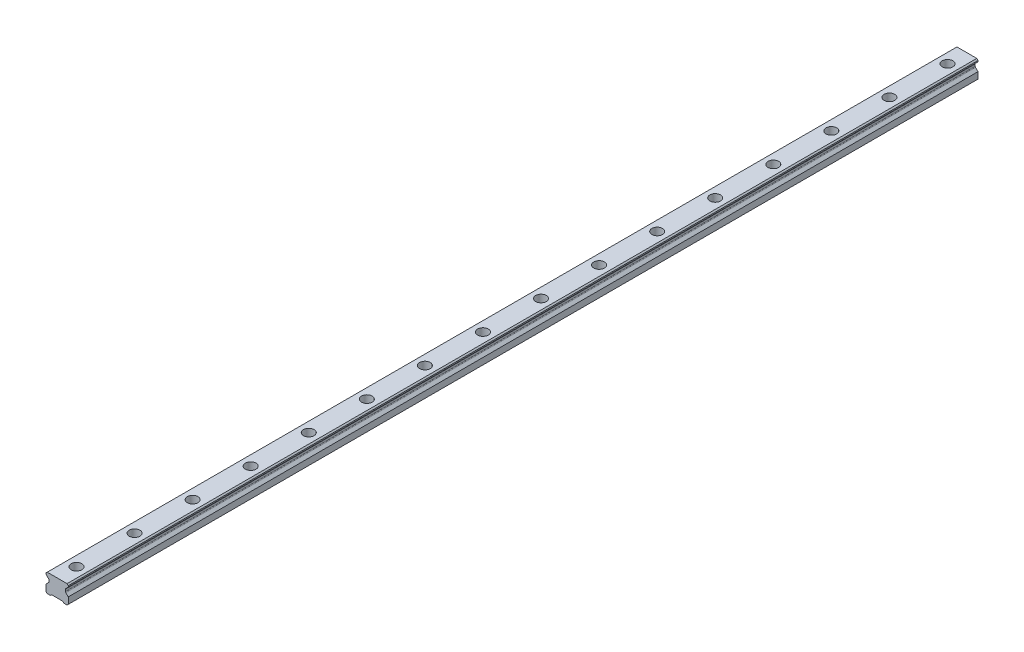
ISO-10303-21;
HEADER;
FILE_DESCRIPTION(('STEP AP214'),'2;1');
FILE_NAME('part.step','',(''),(''),'','','');
FILE_SCHEMA(('AUTOMOTIVE_DESIGN { 1 0 10303 214 1 1 1 1 }'));
ENDSEC;
DATA;
#1=APPLICATION_CONTEXT('core data for automotive mechanical design processes');
#2=APPLICATION_PROTOCOL_DEFINITION('international standard','automotive_design',2000,#1);
#3=PRODUCT_CONTEXT('',#1,'mechanical');
#4=PRODUCT('Part','Part','',(#3));
#5=PRODUCT_RELATED_PRODUCT_CATEGORY('part','',(#4));
#6=PRODUCT_DEFINITION_FORMATION('','',#4);
#7=PRODUCT_DEFINITION_CONTEXT('part definition',#1,'design');
#8=PRODUCT_DEFINITION('design','',#6,#7);
#9=PRODUCT_DEFINITION_SHAPE('','',#8);
#10=(LENGTH_UNIT() NAMED_UNIT(*) SI_UNIT(.MILLI.,.METRE.));
#11=(NAMED_UNIT(*) PLANE_ANGLE_UNIT() SI_UNIT($,.RADIAN.));
#12=(NAMED_UNIT(*) SI_UNIT($,.STERADIAN.) SOLID_ANGLE_UNIT());
#13=UNCERTAINTY_MEASURE_WITH_UNIT(LENGTH_MEASURE(1.E-05),#10,'distance_accuracy_value','');
#14=(GEOMETRIC_REPRESENTATION_CONTEXT(3) GLOBAL_UNCERTAINTY_ASSIGNED_CONTEXT((#13)) GLOBAL_UNIT_ASSIGNED_CONTEXT((#10,
#11,#12)) REPRESENTATION_CONTEXT('',''));
#15=CARTESIAN_POINT('',(0.,0.,0.));
#16=DIRECTION('',(0.,0.,1.));
#17=DIRECTION('',(1.,0.,0.));
#18=AXIS2_PLACEMENT_3D('',#15,#16,#17);
#19=CARTESIAN_POINT('',(0.,10.2,-450.));
#20=DIRECTION('',(0.,1.,0.));
#21=DIRECTION('',(0.,0.,1.));
#22=AXIS2_PLACEMENT_3D('',#19,#20,#21);
#23=PLANE('',#22);
#24=CARTESIAN_POINT('',(0.,10.2,-450.));
#25=DIRECTION('',(0.,1.,0.));
#26=DIRECTION('',(0.,0.,1.));
#27=AXIS2_PLACEMENT_3D('',#24,#25,#26);
#28=CIRCLE('',#27,3.5);
#29=CARTESIAN_POINT('',(0.,10.2,-446.5));
#30=VERTEX_POINT('',#29);
#31=EDGE_CURVE('E470',#30,#30,#28,.T.);
#32=ORIENTED_EDGE('',*,*,#31,.F.);
#33=EDGE_LOOP('',(#32));
#34=FACE_BOUND('',#33,.T.);
#35=CARTESIAN_POINT('',(0.,10.2,-450.));
#36=DIRECTION('',(0.,1.,0.));
#37=DIRECTION('',(0.,0.,1.));
#38=AXIS2_PLACEMENT_3D('',#35,#36,#37);
#39=CIRCLE('',#38,5.5);
#40=CARTESIAN_POINT('',(0.,10.2,-444.5));
#41=VERTEX_POINT('',#40);
#42=EDGE_CURVE('E11',#41,#41,#39,.T.);
#43=ORIENTED_EDGE('',*,*,#42,.T.);
#44=EDGE_LOOP('',(#43));
#45=FACE_BOUND('',#44,.T.);
#46=ADVANCED_FACE('F39',(#34,#45),#23,.T.);
#47=CARTESIAN_POINT('',(0.,10.2,-450.));
#48=DIRECTION('',(0.,1.,0.));
#49=DIRECTION('',(0.,0.,1.));
#50=AXIS2_PLACEMENT_3D('',#47,#48,#49);
#51=CYLINDRICAL_SURFACE('',#50,5.5);
#52=ORIENTED_EDGE('',*,*,#42,.F.);
#53=EDGE_LOOP('',(#52));
#54=FACE_BOUND('',#53,.T.);
#55=CARTESIAN_POINT('',(0.,19.2,-450.));
#56=DIRECTION('',(0.,1.,0.));
#57=DIRECTION('',(0.,0.,1.));
#58=AXIS2_PLACEMENT_3D('',#55,#56,#57);
#59=CIRCLE('',#58,5.5);
#60=CARTESIAN_POINT('',(0.,19.2,-444.5));
#61=VERTEX_POINT('',#60);
#62=EDGE_CURVE('E48',#61,#61,#59,.T.);
#63=ORIENTED_EDGE('',*,*,#62,.T.);
#64=EDGE_LOOP('',(#63));
#65=FACE_BOUND('',#64,.T.);
#66=ADVANCED_FACE('F784',(#54,#65),#51,.F.);
#67=CARTESIAN_POINT('',(0.,10.2,-390.));
#68=DIRECTION('',(0.,1.,0.));
#69=DIRECTION('',(0.,0.,1.));
#70=AXIS2_PLACEMENT_3D('',#67,#68,#69);
#71=PLANE('',#70);
#72=CARTESIAN_POINT('',(0.,10.2,-390.));
#73=DIRECTION('',(0.,1.,0.));
#74=DIRECTION('',(0.,0.,1.));
#75=AXIS2_PLACEMENT_3D('',#72,#73,#74);
#76=CIRCLE('',#75,3.5);
#77=CARTESIAN_POINT('',(0.,10.2,-386.5));
#78=VERTEX_POINT('',#77);
#79=EDGE_CURVE('E475',#78,#78,#76,.T.);
#80=ORIENTED_EDGE('',*,*,#79,.F.);
#81=EDGE_LOOP('',(#80));
#82=FACE_BOUND('',#81,.T.);
#83=CARTESIAN_POINT('',(0.,10.2,-390.));
#84=DIRECTION('',(0.,1.,0.));
#85=DIRECTION('',(0.,0.,1.));
#86=AXIS2_PLACEMENT_3D('',#83,#84,#85);
#87=CIRCLE('',#86,5.5);
#88=CARTESIAN_POINT('',(0.,10.2,-384.5));
#89=VERTEX_POINT('',#88);
#90=EDGE_CURVE('E454',#89,#89,#87,.T.);
#91=ORIENTED_EDGE('',*,*,#90,.T.);
#92=EDGE_LOOP('',(#91));
#93=FACE_BOUND('',#92,.T.);
#94=ADVANCED_FACE('F786',(#82,#93),#71,.T.);
#95=CARTESIAN_POINT('',(0.,10.2,-390.));
#96=DIRECTION('',(0.,1.,0.));
#97=DIRECTION('',(0.,0.,1.));
#98=AXIS2_PLACEMENT_3D('',#95,#96,#97);
#99=CYLINDRICAL_SURFACE('',#98,5.5);
#100=ORIENTED_EDGE('',*,*,#90,.F.);
#101=EDGE_LOOP('',(#100));
#102=FACE_BOUND('',#101,.T.);
#103=CARTESIAN_POINT('',(0.,19.2,-390.));
#104=DIRECTION('',(0.,1.,0.));
#105=DIRECTION('',(0.,0.,1.));
#106=AXIS2_PLACEMENT_3D('',#103,#104,#105);
#107=CIRCLE('',#106,5.5);
#108=CARTESIAN_POINT('',(0.,19.2,-384.5));
#109=VERTEX_POINT('',#108);
#110=EDGE_CURVE('E450',#109,#109,#107,.T.);
#111=ORIENTED_EDGE('',*,*,#110,.T.);
#112=EDGE_LOOP('',(#111));
#113=FACE_BOUND('',#112,.T.);
#114=ADVANCED_FACE('F792',(#102,#113),#99,.F.);
#115=CARTESIAN_POINT('',(0.,10.2,-330.));
#116=DIRECTION('',(0.,1.,0.));
#117=DIRECTION('',(0.,0.,1.));
#118=AXIS2_PLACEMENT_3D('',#115,#116,#117);
#119=PLANE('',#118);
#120=CARTESIAN_POINT('',(0.,10.2,-330.));
#121=DIRECTION('',(0.,1.,0.));
#122=DIRECTION('',(0.,0.,1.));
#123=AXIS2_PLACEMENT_3D('',#120,#121,#122);
#124=CIRCLE('',#123,3.5);
#125=CARTESIAN_POINT('',(0.,10.2,-326.5));
#126=VERTEX_POINT('',#125);
#127=EDGE_CURVE('E480',#126,#126,#124,.T.);
#128=ORIENTED_EDGE('',*,*,#127,.F.);
#129=EDGE_LOOP('',(#128));
#130=FACE_BOUND('',#129,.T.);
#131=CARTESIAN_POINT('',(0.,10.2,-330.));
#132=DIRECTION('',(0.,1.,0.));
#133=DIRECTION('',(0.,0.,1.));
#134=AXIS2_PLACEMENT_3D('',#131,#132,#133);
#135=CIRCLE('',#134,5.5);
#136=CARTESIAN_POINT('',(0.,10.2,-324.5));
#137=VERTEX_POINT('',#136);
#138=EDGE_CURVE('E446',#137,#137,#135,.T.);
#139=ORIENTED_EDGE('',*,*,#138,.T.);
#140=EDGE_LOOP('',(#139));
#141=FACE_BOUND('',#140,.T.);
#142=ADVANCED_FACE('F800',(#130,#141),#119,.T.);
#143=CARTESIAN_POINT('',(0.,10.2,-330.));
#144=DIRECTION('',(0.,1.,0.));
#145=DIRECTION('',(0.,0.,1.));
#146=AXIS2_PLACEMENT_3D('',#143,#144,#145);
#147=CYLINDRICAL_SURFACE('',#146,5.5);
#148=ORIENTED_EDGE('',*,*,#138,.F.);
#149=EDGE_LOOP('',(#148));
#150=FACE_BOUND('',#149,.T.);
#151=CARTESIAN_POINT('',(0.,19.2,-330.));
#152=DIRECTION('',(0.,1.,0.));
#153=DIRECTION('',(0.,0.,1.));
#154=AXIS2_PLACEMENT_3D('',#151,#152,#153);
#155=CIRCLE('',#154,5.5);
#156=CARTESIAN_POINT('',(0.,19.2,-324.5));
#157=VERTEX_POINT('',#156);
#158=EDGE_CURVE('E442',#157,#157,#155,.T.);
#159=ORIENTED_EDGE('',*,*,#158,.T.);
#160=EDGE_LOOP('',(#159));
#161=FACE_BOUND('',#160,.T.);
#162=ADVANCED_FACE('F804',(#150,#161),#147,.F.);
#163=CARTESIAN_POINT('',(0.,10.2,-270.));
#164=DIRECTION('',(0.,1.,0.));
#165=DIRECTION('',(0.,0.,1.));
#166=AXIS2_PLACEMENT_3D('',#163,#164,#165);
#167=PLANE('',#166);
#168=CARTESIAN_POINT('',(0.,10.2,-270.));
#169=DIRECTION('',(0.,1.,0.));
#170=DIRECTION('',(0.,0.,1.));
#171=AXIS2_PLACEMENT_3D('',#168,#169,#170);
#172=CIRCLE('',#171,3.5);
#173=CARTESIAN_POINT('',(0.,10.2,-266.5));
#174=VERTEX_POINT('',#173);
#175=EDGE_CURVE('E485',#174,#174,#172,.T.);
#176=ORIENTED_EDGE('',*,*,#175,.F.);
#177=EDGE_LOOP('',(#176));
#178=FACE_BOUND('',#177,.T.);
#179=CARTESIAN_POINT('',(0.,10.2,-270.));
#180=DIRECTION('',(0.,1.,0.));
#181=DIRECTION('',(0.,0.,1.));
#182=AXIS2_PLACEMENT_3D('',#179,#180,#181);
#183=CIRCLE('',#182,5.5);
#184=CARTESIAN_POINT('',(0.,10.2,-264.5));
#185=VERTEX_POINT('',#184);
#186=EDGE_CURVE('E438',#185,#185,#183,.T.);
#187=ORIENTED_EDGE('',*,*,#186,.T.);
#188=EDGE_LOOP('',(#187));
#189=FACE_BOUND('',#188,.T.);
#190=ADVANCED_FACE('F808',(#178,#189),#167,.T.);
#191=CARTESIAN_POINT('',(0.,10.2,-270.));
#192=DIRECTION('',(0.,1.,0.));
#193=DIRECTION('',(0.,0.,1.));
#194=AXIS2_PLACEMENT_3D('',#191,#192,#193);
#195=CYLINDRICAL_SURFACE('',#194,5.5);
#196=ORIENTED_EDGE('',*,*,#186,.F.);
#197=EDGE_LOOP('',(#196));
#198=FACE_BOUND('',#197,.T.);
#199=CARTESIAN_POINT('',(0.,19.2,-270.));
#200=DIRECTION('',(0.,1.,0.));
#201=DIRECTION('',(0.,0.,1.));
#202=AXIS2_PLACEMENT_3D('',#199,#200,#201);
#203=CIRCLE('',#202,5.5);
#204=CARTESIAN_POINT('',(0.,19.2,-264.5));
#205=VERTEX_POINT('',#204);
#206=EDGE_CURVE('E434',#205,#205,#203,.T.);
#207=ORIENTED_EDGE('',*,*,#206,.T.);
#208=EDGE_LOOP('',(#207));
#209=FACE_BOUND('',#208,.T.);
#210=ADVANCED_FACE('F812',(#198,#209),#195,.F.);
#211=CARTESIAN_POINT('',(0.,10.2,-210.));
#212=DIRECTION('',(0.,1.,0.));
#213=DIRECTION('',(0.,0.,1.));
#214=AXIS2_PLACEMENT_3D('',#211,#212,#213);
#215=PLANE('',#214);
#216=CARTESIAN_POINT('',(0.,10.2,-210.));
#217=DIRECTION('',(0.,1.,0.));
#218=DIRECTION('',(0.,0.,1.));
#219=AXIS2_PLACEMENT_3D('',#216,#217,#218);
#220=CIRCLE('',#219,3.5);
#221=CARTESIAN_POINT('',(0.,10.2,-206.5));
#222=VERTEX_POINT('',#221);
#223=EDGE_CURVE('E490',#222,#222,#220,.T.);
#224=ORIENTED_EDGE('',*,*,#223,.F.);
#225=EDGE_LOOP('',(#224));
#226=FACE_BOUND('',#225,.T.);
#227=CARTESIAN_POINT('',(0.,10.2,-210.));
#228=DIRECTION('',(0.,1.,0.));
#229=DIRECTION('',(0.,0.,1.));
#230=AXIS2_PLACEMENT_3D('',#227,#228,#229);
#231=CIRCLE('',#230,5.5);
#232=CARTESIAN_POINT('',(0.,10.2,-204.5));
#233=VERTEX_POINT('',#232);
#234=EDGE_CURVE('E430',#233,#233,#231,.T.);
#235=ORIENTED_EDGE('',*,*,#234,.T.);
#236=EDGE_LOOP('',(#235));
#237=FACE_BOUND('',#236,.T.);
#238=ADVANCED_FACE('F816',(#226,#237),#215,.T.);
#239=CARTESIAN_POINT('',(0.,10.2,-210.));
#240=DIRECTION('',(0.,1.,0.));
#241=DIRECTION('',(0.,0.,1.));
#242=AXIS2_PLACEMENT_3D('',#239,#240,#241);
#243=CYLINDRICAL_SURFACE('',#242,5.5);
#244=ORIENTED_EDGE('',*,*,#234,.F.);
#245=EDGE_LOOP('',(#244));
#246=FACE_BOUND('',#245,.T.);
#247=CARTESIAN_POINT('',(0.,19.2,-210.));
#248=DIRECTION('',(0.,1.,0.));
#249=DIRECTION('',(0.,0.,1.));
#250=AXIS2_PLACEMENT_3D('',#247,#248,#249);
#251=CIRCLE('',#250,5.5);
#252=CARTESIAN_POINT('',(0.,19.2,-204.5));
#253=VERTEX_POINT('',#252);
#254=EDGE_CURVE('E426',#253,#253,#251,.T.);
#255=ORIENTED_EDGE('',*,*,#254,.T.);
#256=EDGE_LOOP('',(#255));
#257=FACE_BOUND('',#256,.T.);
#258=ADVANCED_FACE('F820',(#246,#257),#243,.F.);
#259=CARTESIAN_POINT('',(0.,10.2,-150.));
#260=DIRECTION('',(0.,1.,0.));
#261=DIRECTION('',(0.,0.,1.));
#262=AXIS2_PLACEMENT_3D('',#259,#260,#261);
#263=PLANE('',#262);
#264=CARTESIAN_POINT('',(0.,10.2,-150.));
#265=DIRECTION('',(0.,1.,0.));
#266=DIRECTION('',(0.,0.,1.));
#267=AXIS2_PLACEMENT_3D('',#264,#265,#266);
#268=CIRCLE('',#267,3.5);
#269=CARTESIAN_POINT('',(0.,10.2,-146.5));
#270=VERTEX_POINT('',#269);
#271=EDGE_CURVE('E495',#270,#270,#268,.T.);
#272=ORIENTED_EDGE('',*,*,#271,.F.);
#273=EDGE_LOOP('',(#272));
#274=FACE_BOUND('',#273,.T.);
#275=CARTESIAN_POINT('',(0.,10.2,-150.));
#276=DIRECTION('',(0.,1.,0.));
#277=DIRECTION('',(0.,0.,1.));
#278=AXIS2_PLACEMENT_3D('',#275,#276,#277);
#279=CIRCLE('',#278,5.5);
#280=CARTESIAN_POINT('',(0.,10.2,-144.5));
#281=VERTEX_POINT('',#280);
#282=EDGE_CURVE('E422',#281,#281,#279,.T.);
#283=ORIENTED_EDGE('',*,*,#282,.T.);
#284=EDGE_LOOP('',(#283));
#285=FACE_BOUND('',#284,.T.);
#286=ADVANCED_FACE('F824',(#274,#285),#263,.T.);
#287=CARTESIAN_POINT('',(0.,10.2,-150.));
#288=DIRECTION('',(0.,1.,0.));
#289=DIRECTION('',(0.,0.,1.));
#290=AXIS2_PLACEMENT_3D('',#287,#288,#289);
#291=CYLINDRICAL_SURFACE('',#290,5.5);
#292=ORIENTED_EDGE('',*,*,#282,.F.);
#293=EDGE_LOOP('',(#292));
#294=FACE_BOUND('',#293,.T.);
#295=CARTESIAN_POINT('',(0.,19.2,-150.));
#296=DIRECTION('',(0.,1.,0.));
#297=DIRECTION('',(0.,0.,1.));
#298=AXIS2_PLACEMENT_3D('',#295,#296,#297);
#299=CIRCLE('',#298,5.5);
#300=CARTESIAN_POINT('',(0.,19.2,-144.5));
#301=VERTEX_POINT('',#300);
#302=EDGE_CURVE('E418',#301,#301,#299,.T.);
#303=ORIENTED_EDGE('',*,*,#302,.T.);
#304=EDGE_LOOP('',(#303));
#305=FACE_BOUND('',#304,.T.);
#306=ADVANCED_FACE('F828',(#294,#305),#291,.F.);
#307=CARTESIAN_POINT('',(0.,10.2,-90.0000000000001));
#308=DIRECTION('',(0.,1.,0.));
#309=DIRECTION('',(0.,0.,1.));
#310=AXIS2_PLACEMENT_3D('',#307,#308,#309);
#311=PLANE('',#310);
#312=CARTESIAN_POINT('',(0.,10.2,-90.0000000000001));
#313=DIRECTION('',(0.,1.,0.));
#314=DIRECTION('',(0.,0.,1.));
#315=AXIS2_PLACEMENT_3D('',#312,#313,#314);
#316=CIRCLE('',#315,3.5);
#317=CARTESIAN_POINT('',(0.,10.2,-86.5000000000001));
#318=VERTEX_POINT('',#317);
#319=EDGE_CURVE('E500',#318,#318,#316,.T.);
#320=ORIENTED_EDGE('',*,*,#319,.F.);
#321=EDGE_LOOP('',(#320));
#322=FACE_BOUND('',#321,.T.);
#323=CARTESIAN_POINT('',(0.,10.2,-90.0000000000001));
#324=DIRECTION('',(0.,1.,0.));
#325=DIRECTION('',(0.,0.,1.));
#326=AXIS2_PLACEMENT_3D('',#323,#324,#325);
#327=CIRCLE('',#326,5.5);
#328=CARTESIAN_POINT('',(0.,10.2,-84.5000000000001));
#329=VERTEX_POINT('',#328);
#330=EDGE_CURVE('E414',#329,#329,#327,.T.);
#331=ORIENTED_EDGE('',*,*,#330,.T.);
#332=EDGE_LOOP('',(#331));
#333=FACE_BOUND('',#332,.T.);
#334=ADVANCED_FACE('F832',(#322,#333),#311,.T.);
#335=CARTESIAN_POINT('',(0.,10.2,-90.0000000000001));
#336=DIRECTION('',(0.,1.,0.));
#337=DIRECTION('',(0.,0.,1.));
#338=AXIS2_PLACEMENT_3D('',#335,#336,#337);
#339=CYLINDRICAL_SURFACE('',#338,5.5);
#340=ORIENTED_EDGE('',*,*,#330,.F.);
#341=EDGE_LOOP('',(#340));
#342=FACE_BOUND('',#341,.T.);
#343=CARTESIAN_POINT('',(0.,19.2,-90.0000000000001));
#344=DIRECTION('',(0.,1.,0.));
#345=DIRECTION('',(0.,0.,1.));
#346=AXIS2_PLACEMENT_3D('',#343,#344,#345);
#347=CIRCLE('',#346,5.5);
#348=CARTESIAN_POINT('',(0.,19.2,-84.5000000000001));
#349=VERTEX_POINT('',#348);
#350=EDGE_CURVE('E410',#349,#349,#347,.T.);
#351=ORIENTED_EDGE('',*,*,#350,.T.);
#352=EDGE_LOOP('',(#351));
#353=FACE_BOUND('',#352,.T.);
#354=ADVANCED_FACE('F836',(#342,#353),#339,.F.);
#355=CARTESIAN_POINT('',(0.,10.2,-30.));
#356=DIRECTION('',(0.,1.,0.));
#357=DIRECTION('',(0.,0.,1.));
#358=AXIS2_PLACEMENT_3D('',#355,#356,#357);
#359=PLANE('',#358);
#360=CARTESIAN_POINT('',(0.,10.2,-30.));
#361=DIRECTION('',(0.,1.,0.));
#362=DIRECTION('',(0.,0.,1.));
#363=AXIS2_PLACEMENT_3D('',#360,#361,#362);
#364=CIRCLE('',#363,3.5);
#365=CARTESIAN_POINT('',(0.,10.2,-26.5));
#366=VERTEX_POINT('',#365);
#367=EDGE_CURVE('E505',#366,#366,#364,.T.);
#368=ORIENTED_EDGE('',*,*,#367,.F.);
#369=EDGE_LOOP('',(#368));
#370=FACE_BOUND('',#369,.T.);
#371=CARTESIAN_POINT('',(0.,10.2,-30.));
#372=DIRECTION('',(0.,1.,0.));
#373=DIRECTION('',(0.,0.,1.));
#374=AXIS2_PLACEMENT_3D('',#371,#372,#373);
#375=CIRCLE('',#374,5.5);
#376=CARTESIAN_POINT('',(0.,10.2,-24.5));
#377=VERTEX_POINT('',#376);
#378=EDGE_CURVE('E406',#377,#377,#375,.T.);
#379=ORIENTED_EDGE('',*,*,#378,.T.);
#380=EDGE_LOOP('',(#379));
#381=FACE_BOUND('',#380,.T.);
#382=ADVANCED_FACE('F840',(#370,#381),#359,.T.);
#383=CARTESIAN_POINT('',(0.,10.2,-30.));
#384=DIRECTION('',(0.,1.,0.));
#385=DIRECTION('',(0.,0.,1.));
#386=AXIS2_PLACEMENT_3D('',#383,#384,#385);
#387=CYLINDRICAL_SURFACE('',#386,5.5);
#388=ORIENTED_EDGE('',*,*,#378,.F.);
#389=EDGE_LOOP('',(#388));
#390=FACE_BOUND('',#389,.T.);
#391=CARTESIAN_POINT('',(0.,19.2,-30.));
#392=DIRECTION('',(0.,1.,0.));
#393=DIRECTION('',(0.,0.,1.));
#394=AXIS2_PLACEMENT_3D('',#391,#392,#393);
#395=CIRCLE('',#394,5.5);
#396=CARTESIAN_POINT('',(0.,19.2,-24.5));
#397=VERTEX_POINT('',#396);
#398=EDGE_CURVE('E402',#397,#397,#395,.T.);
#399=ORIENTED_EDGE('',*,*,#398,.T.);
#400=EDGE_LOOP('',(#399));
#401=FACE_BOUND('',#400,.T.);
#402=ADVANCED_FACE('F844',(#390,#401),#387,.F.);
#403=CARTESIAN_POINT('',(0.,10.2,30.));
#404=DIRECTION('',(0.,1.,0.));
#405=DIRECTION('',(0.,0.,1.));
#406=AXIS2_PLACEMENT_3D('',#403,#404,#405);
#407=PLANE('',#406);
#408=CARTESIAN_POINT('',(0.,10.2,30.));
#409=DIRECTION('',(0.,1.,0.));
#410=DIRECTION('',(0.,0.,1.));
#411=AXIS2_PLACEMENT_3D('',#408,#409,#410);
#412=CIRCLE('',#411,3.5);
#413=CARTESIAN_POINT('',(0.,10.2,33.5));
#414=VERTEX_POINT('',#413);
#415=EDGE_CURVE('E510',#414,#414,#412,.T.);
#416=ORIENTED_EDGE('',*,*,#415,.F.);
#417=EDGE_LOOP('',(#416));
#418=FACE_BOUND('',#417,.T.);
#419=CARTESIAN_POINT('',(0.,10.2,30.));
#420=DIRECTION('',(0.,1.,0.));
#421=DIRECTION('',(0.,0.,1.));
#422=AXIS2_PLACEMENT_3D('',#419,#420,#421);
#423=CIRCLE('',#422,5.5);
#424=CARTESIAN_POINT('',(0.,10.2,35.5));
#425=VERTEX_POINT('',#424);
#426=EDGE_CURVE('E398',#425,#425,#423,.T.);
#427=ORIENTED_EDGE('',*,*,#426,.T.);
#428=EDGE_LOOP('',(#427));
#429=FACE_BOUND('',#428,.T.);
#430=ADVANCED_FACE('F848',(#418,#429),#407,.T.);
#431=CARTESIAN_POINT('',(0.,10.2,30.));
#432=DIRECTION('',(0.,1.,0.));
#433=DIRECTION('',(0.,0.,1.));
#434=AXIS2_PLACEMENT_3D('',#431,#432,#433);
#435=CYLINDRICAL_SURFACE('',#434,5.5);
#436=ORIENTED_EDGE('',*,*,#426,.F.);
#437=EDGE_LOOP('',(#436));
#438=FACE_BOUND('',#437,.T.);
#439=CARTESIAN_POINT('',(0.,19.2,30.));
#440=DIRECTION('',(0.,1.,0.));
#441=DIRECTION('',(0.,0.,1.));
#442=AXIS2_PLACEMENT_3D('',#439,#440,#441);
#443=CIRCLE('',#442,5.5);
#444=CARTESIAN_POINT('',(0.,19.2,35.5));
#445=VERTEX_POINT('',#444);
#446=EDGE_CURVE('E394',#445,#445,#443,.T.);
#447=ORIENTED_EDGE('',*,*,#446,.T.);
#448=EDGE_LOOP('',(#447));
#449=FACE_BOUND('',#448,.T.);
#450=ADVANCED_FACE('F750',(#438,#449),#435,.F.);
#451=CARTESIAN_POINT('',(0.,10.2,90.));
#452=DIRECTION('',(0.,1.,0.));
#453=DIRECTION('',(0.,0.,1.));
#454=AXIS2_PLACEMENT_3D('',#451,#452,#453);
#455=PLANE('',#454);
#456=CARTESIAN_POINT('',(0.,10.2,90.));
#457=DIRECTION('',(0.,1.,0.));
#458=DIRECTION('',(0.,0.,1.));
#459=AXIS2_PLACEMENT_3D('',#456,#457,#458);
#460=CIRCLE('',#459,3.5);
#461=CARTESIAN_POINT('',(0.,10.2,93.5));
#462=VERTEX_POINT('',#461);
#463=EDGE_CURVE('E515',#462,#462,#460,.T.);
#464=ORIENTED_EDGE('',*,*,#463,.F.);
#465=EDGE_LOOP('',(#464));
#466=FACE_BOUND('',#465,.T.);
#467=CARTESIAN_POINT('',(0.,10.2,90.));
#468=DIRECTION('',(0.,1.,0.));
#469=DIRECTION('',(0.,0.,1.));
#470=AXIS2_PLACEMENT_3D('',#467,#468,#469);
#471=CIRCLE('',#470,5.5);
#472=CARTESIAN_POINT('',(0.,10.2,95.5));
#473=VERTEX_POINT('',#472);
#474=EDGE_CURVE('E390',#473,#473,#471,.T.);
#475=ORIENTED_EDGE('',*,*,#474,.T.);
#476=EDGE_LOOP('',(#475));
#477=FACE_BOUND('',#476,.T.);
#478=ADVANCED_FACE('F746',(#466,#477),#455,.T.);
#479=CARTESIAN_POINT('',(0.,10.2,90.));
#480=DIRECTION('',(0.,1.,0.));
#481=DIRECTION('',(0.,0.,1.));
#482=AXIS2_PLACEMENT_3D('',#479,#480,#481);
#483=CYLINDRICAL_SURFACE('',#482,5.5);
#484=ORIENTED_EDGE('',*,*,#474,.F.);
#485=EDGE_LOOP('',(#484));
#486=FACE_BOUND('',#485,.T.);
#487=CARTESIAN_POINT('',(0.,19.2,90.));
#488=DIRECTION('',(0.,1.,0.));
#489=DIRECTION('',(0.,0.,1.));
#490=AXIS2_PLACEMENT_3D('',#487,#488,#489);
#491=CIRCLE('',#490,5.5);
#492=CARTESIAN_POINT('',(0.,19.2,95.5));
#493=VERTEX_POINT('',#492);
#494=EDGE_CURVE('E386',#493,#493,#491,.T.);
#495=ORIENTED_EDGE('',*,*,#494,.T.);
#496=EDGE_LOOP('',(#495));
#497=FACE_BOUND('',#496,.T.);
#498=ADVANCED_FACE('F749',(#486,#497),#483,.F.);
#499=CARTESIAN_POINT('',(0.,10.2,150.));
#500=DIRECTION('',(0.,1.,0.));
#501=DIRECTION('',(0.,0.,1.));
#502=AXIS2_PLACEMENT_3D('',#499,#500,#501);
#503=PLANE('',#502);
#504=CARTESIAN_POINT('',(0.,10.2,150.));
#505=DIRECTION('',(0.,1.,0.));
#506=DIRECTION('',(0.,0.,1.));
#507=AXIS2_PLACEMENT_3D('',#504,#505,#506);
#508=CIRCLE('',#507,3.5);
#509=CARTESIAN_POINT('',(0.,10.2,153.5));
#510=VERTEX_POINT('',#509);
#511=EDGE_CURVE('E520',#510,#510,#508,.T.);
#512=ORIENTED_EDGE('',*,*,#511,.F.);
#513=EDGE_LOOP('',(#512));
#514=FACE_BOUND('',#513,.T.);
#515=CARTESIAN_POINT('',(0.,10.2,150.));
#516=DIRECTION('',(0.,1.,0.));
#517=DIRECTION('',(0.,0.,1.));
#518=AXIS2_PLACEMENT_3D('',#515,#516,#517);
#519=CIRCLE('',#518,5.5);
#520=CARTESIAN_POINT('',(0.,10.2,155.5));
#521=VERTEX_POINT('',#520);
#522=EDGE_CURVE('E382',#521,#521,#519,.T.);
#523=ORIENTED_EDGE('',*,*,#522,.T.);
#524=EDGE_LOOP('',(#523));
#525=FACE_BOUND('',#524,.T.);
#526=ADVANCED_FACE('F756',(#514,#525),#503,.T.);
#527=CARTESIAN_POINT('',(0.,10.2,150.));
#528=DIRECTION('',(0.,1.,0.));
#529=DIRECTION('',(0.,0.,1.));
#530=AXIS2_PLACEMENT_3D('',#527,#528,#529);
#531=CYLINDRICAL_SURFACE('',#530,5.5);
#532=ORIENTED_EDGE('',*,*,#522,.F.);
#533=EDGE_LOOP('',(#532));
#534=FACE_BOUND('',#533,.T.);
#535=CARTESIAN_POINT('',(0.,19.2,150.));
#536=DIRECTION('',(0.,1.,0.));
#537=DIRECTION('',(0.,0.,1.));
#538=AXIS2_PLACEMENT_3D('',#535,#536,#537);
#539=CIRCLE('',#538,5.5);
#540=CARTESIAN_POINT('',(0.,19.2,155.5));
#541=VERTEX_POINT('',#540);
#542=EDGE_CURVE('E378',#541,#541,#539,.T.);
#543=ORIENTED_EDGE('',*,*,#542,.T.);
#544=EDGE_LOOP('',(#543));
#545=FACE_BOUND('',#544,.T.);
#546=ADVANCED_FACE('F858',(#534,#545),#531,.F.);
#547=CARTESIAN_POINT('',(0.,10.2,210.));
#548=DIRECTION('',(0.,1.,0.));
#549=DIRECTION('',(0.,0.,1.));
#550=AXIS2_PLACEMENT_3D('',#547,#548,#549);
#551=PLANE('',#550);
#552=CARTESIAN_POINT('',(0.,10.2,210.));
#553=DIRECTION('',(0.,1.,0.));
#554=DIRECTION('',(0.,0.,1.));
#555=AXIS2_PLACEMENT_3D('',#552,#553,#554);
#556=CIRCLE('',#555,3.5);
#557=CARTESIAN_POINT('',(0.,10.2,213.5));
#558=VERTEX_POINT('',#557);
#559=EDGE_CURVE('E524',#558,#558,#556,.T.);
#560=ORIENTED_EDGE('',*,*,#559,.F.);
#561=EDGE_LOOP('',(#560));
#562=FACE_BOUND('',#561,.T.);
#563=CARTESIAN_POINT('',(0.,10.2,210.));
#564=DIRECTION('',(0.,1.,0.));
#565=DIRECTION('',(0.,0.,1.));
#566=AXIS2_PLACEMENT_3D('',#563,#564,#565);
#567=CIRCLE('',#566,5.5);
#568=CARTESIAN_POINT('',(0.,10.2,215.5));
#569=VERTEX_POINT('',#568);
#570=EDGE_CURVE('E374',#569,#569,#567,.T.);
#571=ORIENTED_EDGE('',*,*,#570,.T.);
#572=EDGE_LOOP('',(#571));
#573=FACE_BOUND('',#572,.T.);
#574=ADVANCED_FACE('F862',(#562,#573),#551,.T.);
#575=CARTESIAN_POINT('',(0.,10.2,210.));
#576=DIRECTION('',(0.,1.,0.));
#577=DIRECTION('',(0.,0.,1.));
#578=AXIS2_PLACEMENT_3D('',#575,#576,#577);
#579=CYLINDRICAL_SURFACE('',#578,5.5);
#580=ORIENTED_EDGE('',*,*,#570,.F.);
#581=EDGE_LOOP('',(#580));
#582=FACE_BOUND('',#581,.T.);
#583=CARTESIAN_POINT('',(0.,19.2,210.));
#584=DIRECTION('',(0.,1.,0.));
#585=DIRECTION('',(0.,0.,1.));
#586=AXIS2_PLACEMENT_3D('',#583,#584,#585);
#587=CIRCLE('',#586,5.5);
#588=CARTESIAN_POINT('',(0.,19.2,215.5));
#589=VERTEX_POINT('',#588);
#590=EDGE_CURVE('E370',#589,#589,#587,.T.);
#591=ORIENTED_EDGE('',*,*,#590,.T.);
#592=EDGE_LOOP('',(#591));
#593=FACE_BOUND('',#592,.T.);
#594=ADVANCED_FACE('F866',(#582,#593),#579,.F.);
#595=CARTESIAN_POINT('',(0.,10.2,270.));
#596=DIRECTION('',(0.,1.,0.));
#597=DIRECTION('',(0.,0.,1.));
#598=AXIS2_PLACEMENT_3D('',#595,#596,#597);
#599=PLANE('',#598);
#600=CARTESIAN_POINT('',(0.,10.2,270.));
#601=DIRECTION('',(0.,1.,0.));
#602=DIRECTION('',(0.,0.,1.));
#603=AXIS2_PLACEMENT_3D('',#600,#601,#602);
#604=CIRCLE('',#603,3.5);
#605=CARTESIAN_POINT('',(0.,10.2,273.5));
#606=VERTEX_POINT('',#605);
#607=EDGE_CURVE('E528',#606,#606,#604,.T.);
#608=ORIENTED_EDGE('',*,*,#607,.F.);
#609=EDGE_LOOP('',(#608));
#610=FACE_BOUND('',#609,.T.);
#611=CARTESIAN_POINT('',(0.,10.2,270.));
#612=DIRECTION('',(0.,1.,0.));
#613=DIRECTION('',(0.,0.,1.));
#614=AXIS2_PLACEMENT_3D('',#611,#612,#613);
#615=CIRCLE('',#614,5.5);
#616=CARTESIAN_POINT('',(0.,10.2,275.5));
#617=VERTEX_POINT('',#616);
#618=EDGE_CURVE('E366',#617,#617,#615,.T.);
#619=ORIENTED_EDGE('',*,*,#618,.T.);
#620=EDGE_LOOP('',(#619));
#621=FACE_BOUND('',#620,.T.);
#622=ADVANCED_FACE('F870',(#610,#621),#599,.T.);
#623=CARTESIAN_POINT('',(0.,10.2,270.));
#624=DIRECTION('',(0.,1.,0.));
#625=DIRECTION('',(0.,0.,1.));
#626=AXIS2_PLACEMENT_3D('',#623,#624,#625);
#627=CYLINDRICAL_SURFACE('',#626,5.5);
#628=ORIENTED_EDGE('',*,*,#618,.F.);
#629=EDGE_LOOP('',(#628));
#630=FACE_BOUND('',#629,.T.);
#631=CARTESIAN_POINT('',(0.,19.2,270.));
#632=DIRECTION('',(0.,1.,0.));
#633=DIRECTION('',(0.,0.,1.));
#634=AXIS2_PLACEMENT_3D('',#631,#632,#633);
#635=CIRCLE('',#634,5.5);
#636=CARTESIAN_POINT('',(0.,19.2,275.5));
#637=VERTEX_POINT('',#636);
#638=EDGE_CURVE('E362',#637,#637,#635,.T.);
#639=ORIENTED_EDGE('',*,*,#638,.T.);
#640=EDGE_LOOP('',(#639));
#641=FACE_BOUND('',#640,.T.);
#642=ADVANCED_FACE('F874',(#630,#641),#627,.F.);
#643=CARTESIAN_POINT('',(0.,10.2,330.));
#644=DIRECTION('',(0.,1.,0.));
#645=DIRECTION('',(0.,0.,1.));
#646=AXIS2_PLACEMENT_3D('',#643,#644,#645);
#647=PLANE('',#646);
#648=CARTESIAN_POINT('',(0.,10.2,330.));
#649=DIRECTION('',(0.,1.,0.));
#650=DIRECTION('',(0.,0.,1.));
#651=AXIS2_PLACEMENT_3D('',#648,#649,#650);
#652=CIRCLE('',#651,3.5);
#653=CARTESIAN_POINT('',(0.,10.2,333.5));
#654=VERTEX_POINT('',#653);
#655=EDGE_CURVE('E542',#654,#654,#652,.T.);
#656=ORIENTED_EDGE('',*,*,#655,.F.);
#657=EDGE_LOOP('',(#656));
#658=FACE_BOUND('',#657,.T.);
#659=CARTESIAN_POINT('',(0.,10.2,330.));
#660=DIRECTION('',(0.,1.,0.));
#661=DIRECTION('',(0.,0.,1.));
#662=AXIS2_PLACEMENT_3D('',#659,#660,#661);
#663=CIRCLE('',#662,5.5);
#664=CARTESIAN_POINT('',(0.,10.2,335.5));
#665=VERTEX_POINT('',#664);
#666=EDGE_CURVE('E358',#665,#665,#663,.T.);
#667=ORIENTED_EDGE('',*,*,#666,.T.);
#668=EDGE_LOOP('',(#667));
#669=FACE_BOUND('',#668,.T.);
#670=ADVANCED_FACE('F878',(#658,#669),#647,.T.);
#671=CARTESIAN_POINT('',(0.,10.2,330.));
#672=DIRECTION('',(0.,1.,0.));
#673=DIRECTION('',(0.,0.,1.));
#674=AXIS2_PLACEMENT_3D('',#671,#672,#673);
#675=CYLINDRICAL_SURFACE('',#674,5.5);
#676=ORIENTED_EDGE('',*,*,#666,.F.);
#677=EDGE_LOOP('',(#676));
#678=FACE_BOUND('',#677,.T.);
#679=CARTESIAN_POINT('',(0.,19.2,330.));
#680=DIRECTION('',(0.,1.,0.));
#681=DIRECTION('',(0.,0.,1.));
#682=AXIS2_PLACEMENT_3D('',#679,#680,#681);
#683=CIRCLE('',#682,5.5);
#684=CARTESIAN_POINT('',(0.,19.2,335.5));
#685=VERTEX_POINT('',#684);
#686=EDGE_CURVE('E354',#685,#685,#683,.T.);
#687=ORIENTED_EDGE('',*,*,#686,.T.);
#688=EDGE_LOOP('',(#687));
#689=FACE_BOUND('',#688,.T.);
#690=ADVANCED_FACE('F882',(#678,#689),#675,.F.);
#691=CARTESIAN_POINT('',(11.5,0.,470.));
#692=DIRECTION('',(0.,1.,0.));
#693=DIRECTION('',(-1.,0.,0.));
#694=AXIS2_PLACEMENT_3D('',#691,#692,#693);
#695=PLANE('',#694);
#696=DIRECTION('',(1.,0.,0.));
#697=VECTOR('',#696,1.);
#698=CARTESIAN_POINT('',(11.5,0.,-470.));
#699=LINE('',#698,#697);
#700=CARTESIAN_POINT('',(-10.25,0.,-470.));
#701=VERTEX_POINT('',#700);
#702=CARTESIAN_POINT('',(-7.,0.,-470.));
#703=VERTEX_POINT('',#702);
#704=EDGE_CURVE('E229',#701,#703,#699,.T.);
#705=ORIENTED_EDGE('',*,*,#704,.T.);
#706=DIRECTION('',(0.,0.,1.));
#707=VECTOR('',#706,1.);
#708=CARTESIAN_POINT('',(-7.,0.,-470.));
#709=LINE('',#708,#707);
#710=CARTESIAN_POINT('',(-7.,0.,470.));
#711=VERTEX_POINT('',#710);
#712=EDGE_CURVE('E582',#703,#711,#709,.T.);
#713=ORIENTED_EDGE('',*,*,#712,.T.);
#714=DIRECTION('',(1.,0.,0.));
#715=VECTOR('',#714,1.);
#716=CARTESIAN_POINT('',(11.5,0.,470.));
#717=LINE('',#716,#715);
#718=CARTESIAN_POINT('',(-10.25,0.,470.));
#719=VERTEX_POINT('',#718);
#720=EDGE_CURVE('E652',#719,#711,#717,.T.);
#721=ORIENTED_EDGE('',*,*,#720,.F.);
#722=DIRECTION('',(0.,0.,-1.));
#723=VECTOR('',#722,1.);
#724=CARTESIAN_POINT('',(-10.25,0.,470.));
#725=LINE('',#724,#723);
#726=EDGE_CURVE('E290',#719,#701,#725,.T.);
#727=ORIENTED_EDGE('',*,*,#726,.T.);
#728=EDGE_LOOP('',(#705,#713,#721,#727));
#729=FACE_BOUND('',#728,.T.);
#730=ADVANCED_FACE('F886',(#729),#695,.F.);
#731=CARTESIAN_POINT('',(-11.5,19.2,470.));
#732=DIRECTION('',(1.,0.,0.));
#733=DIRECTION('',(0.,1.,0.));
#734=AXIS2_PLACEMENT_3D('',#731,#732,#733);
#735=PLANE('',#734);
#736=DIRECTION('',(0.,-1.,0.));
#737=VECTOR('',#736,1.);
#738=CARTESIAN_POINT('',(-11.5,19.2,470.));
#739=LINE('',#738,#737);
#740=CARTESIAN_POINT('',(-11.5,17.95,470.));
#741=VERTEX_POINT('',#740);
#742=CARTESIAN_POINT('',(-11.5,16.7,470.));
#743=VERTEX_POINT('',#742);
#744=EDGE_CURVE('E648',#741,#743,#739,.T.);
#745=ORIENTED_EDGE('',*,*,#744,.F.);
#746=DIRECTION('',(0.,0.,-1.));
#747=VECTOR('',#746,1.);
#748=CARTESIAN_POINT('',(-11.5,17.95,470.));
#749=LINE('',#748,#747);
#750=CARTESIAN_POINT('',(-11.5,17.95,-470.));
#751=VERTEX_POINT('',#750);
#752=EDGE_CURVE('E252',#741,#751,#749,.T.);
#753=ORIENTED_EDGE('',*,*,#752,.T.);
#754=DIRECTION('',(0.,-1.,0.));
#755=VECTOR('',#754,1.);
#756=CARTESIAN_POINT('',(-11.5,19.2,-470.));
#757=LINE('',#756,#755);
#758=CARTESIAN_POINT('',(-11.5,16.7,-470.));
#759=VERTEX_POINT('',#758);
#760=EDGE_CURVE('E230',#751,#759,#757,.T.);
#761=ORIENTED_EDGE('',*,*,#760,.T.);
#762=DIRECTION('',(0.,0.,1.));
#763=VECTOR('',#762,1.);
#764=CARTESIAN_POINT('',(-11.5,16.7,-470.));
#765=LINE('',#764,#763);
#766=EDGE_CURVE('E603',#759,#743,#765,.T.);
#767=ORIENTED_EDGE('',*,*,#766,.T.);
#768=EDGE_LOOP('',(#745,#753,#761,#767));
#769=FACE_BOUND('',#768,.T.);
#770=ADVANCED_FACE('F677',(#769),#735,.F.);
#771=CARTESIAN_POINT('',(11.5,19.2,470.));
#772=DIRECTION('',(-1.,0.,0.));
#773=DIRECTION('',(0.,0.,1.));
#774=AXIS2_PLACEMENT_3D('',#771,#772,#773);
#775=PLANE('',#774);
#776=DIRECTION('',(0.,1.,0.));
#777=VECTOR('',#776,1.);
#778=CARTESIAN_POINT('',(11.5,19.2,470.));
#779=LINE('',#778,#777);
#780=CARTESIAN_POINT('',(11.5,1.24999999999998,470.));
#781=VERTEX_POINT('',#780);
#782=CARTESIAN_POINT('',(11.5,7.95,470.));
#783=VERTEX_POINT('',#782);
#784=EDGE_CURVE('E657',#781,#783,#779,.T.);
#785=ORIENTED_EDGE('',*,*,#784,.F.);
#786=DIRECTION('',(0.,0.,-1.));
#787=VECTOR('',#786,1.);
#788=CARTESIAN_POINT('',(11.5,1.24999999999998,470.));
#789=LINE('',#788,#787);
#790=CARTESIAN_POINT('',(11.5,1.24999999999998,-470.));
#791=VERTEX_POINT('',#790);
#792=EDGE_CURVE('E296',#781,#791,#789,.T.);
#793=ORIENTED_EDGE('',*,*,#792,.T.);
#794=DIRECTION('',(0.,1.,0.));
#795=VECTOR('',#794,1.);
#796=CARTESIAN_POINT('',(11.5,19.2,-470.));
#797=LINE('',#796,#795);
#798=CARTESIAN_POINT('',(11.5,7.95,-470.));
#799=VERTEX_POINT('',#798);
#800=EDGE_CURVE('E243',#791,#799,#797,.T.);
#801=ORIENTED_EDGE('',*,*,#800,.T.);
#802=DIRECTION('',(0.,0.,1.));
#803=VECTOR('',#802,1.);
#804=CARTESIAN_POINT('',(11.5,7.95,-470.));
#805=LINE('',#804,#803);
#806=EDGE_CURVE('E633',#799,#783,#805,.T.);
#807=ORIENTED_EDGE('',*,*,#806,.T.);
#808=EDGE_LOOP('',(#785,#793,#801,#807));
#809=FACE_BOUND('',#808,.T.);
#810=ADVANCED_FACE('F917',(#809),#775,.F.);
#811=CARTESIAN_POINT('',(-11.5,7.95,-470.));
#812=VERTEX_POINT('',#811);
#813=CARTESIAN_POINT('',(-11.5,1.24999999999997,-470.));
#814=VERTEX_POINT('',#813);
#815=EDGE_CURVE('E239',#812,#814,#757,.T.);
#816=ORIENTED_EDGE('',*,*,#815,.T.);
#817=DIRECTION('',(0.,0.,1.));
#818=VECTOR('',#817,1.);
#819=CARTESIAN_POINT('',(-11.5,1.24999999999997,470.));
#820=LINE('',#819,#818);
#821=CARTESIAN_POINT('',(-11.5,1.24999999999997,470.));
#822=VERTEX_POINT('',#821);
#823=EDGE_CURVE('E293',#814,#822,#820,.T.);
#824=ORIENTED_EDGE('',*,*,#823,.T.);
#825=CARTESIAN_POINT('',(-11.5,7.95,470.));
#826=VERTEX_POINT('',#825);
#827=EDGE_CURVE('E251',#826,#822,#739,.T.);
#828=ORIENTED_EDGE('',*,*,#827,.F.);
#829=DIRECTION('',(0.,0.,1.));
#830=VECTOR('',#829,1.);
#831=CARTESIAN_POINT('',(-11.5,7.95,-470.));
#832=LINE('',#831,#830);
#833=EDGE_CURVE('E615',#812,#826,#832,.T.);
#834=ORIENTED_EDGE('',*,*,#833,.F.);
#835=EDGE_LOOP('',(#816,#824,#828,#834));
#836=FACE_BOUND('',#835,.T.);
#837=ADVANCED_FACE('F705',(#836),#735,.F.);
#838=CARTESIAN_POINT('',(7.,0.,470.));
#839=VERTEX_POINT('',#838);
#840=CARTESIAN_POINT('',(10.25,0.,470.));
#841=VERTEX_POINT('',#840);
#842=EDGE_CURVE('E219',#839,#841,#717,.T.);
#843=ORIENTED_EDGE('',*,*,#842,.F.);
#844=DIRECTION('',(0.,0.,1.));
#845=VECTOR('',#844,1.);
#846=CARTESIAN_POINT('',(7.,0.,-470.));
#847=LINE('',#846,#845);
#848=CARTESIAN_POINT('',(7.,0.,-470.));
#849=VERTEX_POINT('',#848);
#850=EDGE_CURVE('E206',#849,#839,#847,.T.);
#851=ORIENTED_EDGE('',*,*,#850,.F.);
#852=CARTESIAN_POINT('',(10.25,0.,-470.));
#853=VERTEX_POINT('',#852);
#854=EDGE_CURVE('E217',#849,#853,#699,.T.);
#855=ORIENTED_EDGE('',*,*,#854,.T.);
#856=DIRECTION('',(0.,0.,1.));
#857=VECTOR('',#856,1.);
#858=CARTESIAN_POINT('',(10.25,0.,470.));
#859=LINE('',#858,#857);
#860=EDGE_CURVE('E287',#853,#841,#859,.T.);
#861=ORIENTED_EDGE('',*,*,#860,.T.);
#862=EDGE_LOOP('',(#843,#851,#855,#861));
#863=FACE_BOUND('',#862,.T.);
#864=ADVANCED_FACE('F215',(#863),#695,.F.);
#865=CARTESIAN_POINT('',(11.5,16.7,-470.));
#866=VERTEX_POINT('',#865);
#867=CARTESIAN_POINT('',(11.5,17.95,-470.));
#868=VERTEX_POINT('',#867);
#869=EDGE_CURVE('E236',#866,#868,#797,.T.);
#870=ORIENTED_EDGE('',*,*,#869,.T.);
#871=DIRECTION('',(0.,0.,1.));
#872=VECTOR('',#871,1.);
#873=CARTESIAN_POINT('',(11.5,17.95,470.));
#874=LINE('',#873,#872);
#875=CARTESIAN_POINT('',(11.5,17.95,470.));
#876=VERTEX_POINT('',#875);
#877=EDGE_CURVE('E300',#868,#876,#874,.T.);
#878=ORIENTED_EDGE('',*,*,#877,.T.);
#879=CARTESIAN_POINT('',(11.5,16.7,470.));
#880=VERTEX_POINT('',#879);
#881=EDGE_CURVE('E656',#880,#876,#779,.T.);
#882=ORIENTED_EDGE('',*,*,#881,.F.);
#883=DIRECTION('',(0.,0.,1.));
#884=VECTOR('',#883,1.);
#885=CARTESIAN_POINT('',(11.5,16.7,-470.));
#886=LINE('',#885,#884);
#887=EDGE_CURVE('E608',#866,#880,#886,.T.);
#888=ORIENTED_EDGE('',*,*,#887,.F.);
#889=EDGE_LOOP('',(#870,#878,#882,#888));
#890=FACE_BOUND('',#889,.T.);
#891=ADVANCED_FACE('F763',(#890),#775,.F.);
#892=CARTESIAN_POINT('',(11.5,19.2,470.));
#893=DIRECTION('',(0.,-1.,0.));
#894=DIRECTION('',(0.,0.,-1.));
#895=AXIS2_PLACEMENT_3D('',#892,#893,#894);
#896=PLANE('',#895);
#897=CARTESIAN_POINT('',(0.,19.2,390.));
#898=DIRECTION('',(0.,1.,0.));
#899=DIRECTION('',(0.,0.,1.));
#900=AXIS2_PLACEMENT_3D('',#897,#898,#899);
#901=CIRCLE('',#900,5.5);
#902=CARTESIAN_POINT('',(0.,19.2,395.5));
#903=VERTEX_POINT('',#902);
#904=EDGE_CURVE('E546',#903,#903,#901,.T.);
#905=ORIENTED_EDGE('',*,*,#904,.F.);
#906=EDGE_LOOP('',(#905));
#907=FACE_BOUND('',#906,.T.);
#908=CARTESIAN_POINT('',(0.,19.2,450.));
#909=DIRECTION('',(0.,1.,0.));
#910=DIRECTION('',(0.,0.,1.));
#911=AXIS2_PLACEMENT_3D('',#908,#909,#910);
#912=CIRCLE('',#911,5.5);
#913=CARTESIAN_POINT('',(0.,19.2,455.5));
#914=VERTEX_POINT('',#913);
#915=EDGE_CURVE('E562',#914,#914,#912,.T.);
#916=ORIENTED_EDGE('',*,*,#915,.F.);
#917=EDGE_LOOP('',(#916));
#918=FACE_BOUND('',#917,.T.);
#919=DIRECTION('',(-1.,0.,0.));
#920=VECTOR('',#919,1.);
#921=CARTESIAN_POINT('',(11.5,19.2,-470.));
#922=LINE('',#921,#920);
#923=CARTESIAN_POINT('',(10.25,19.2,-470.));
#924=VERTEX_POINT('',#923);
#925=CARTESIAN_POINT('',(-10.25,19.2,-470.));
#926=VERTEX_POINT('',#925);
#927=EDGE_CURVE('E247',#924,#926,#922,.T.);
#928=ORIENTED_EDGE('',*,*,#927,.T.);
#929=DIRECTION('',(0.,0.,1.));
#930=VECTOR('',#929,1.);
#931=CARTESIAN_POINT('',(-10.25,19.2,470.));
#932=LINE('',#931,#930);
#933=CARTESIAN_POINT('',(-10.25,19.2,470.));
#934=VERTEX_POINT('',#933);
#935=EDGE_CURVE('E272',#926,#934,#932,.T.);
#936=ORIENTED_EDGE('',*,*,#935,.T.);
#937=DIRECTION('',(-1.,0.,0.));
#938=VECTOR('',#937,1.);
#939=CARTESIAN_POINT('',(11.5,19.2,470.));
#940=LINE('',#939,#938);
#941=CARTESIAN_POINT('',(10.25,19.2,470.));
#942=VERTEX_POINT('',#941);
#943=EDGE_CURVE('E257',#942,#934,#940,.T.);
#944=ORIENTED_EDGE('',*,*,#943,.F.);
#945=DIRECTION('',(0.,0.,-1.));
#946=VECTOR('',#945,1.);
#947=CARTESIAN_POINT('',(10.25,19.2,470.));
#948=LINE('',#947,#946);
#949=EDGE_CURVE('E268',#942,#924,#948,.T.);
#950=ORIENTED_EDGE('',*,*,#949,.T.);
#951=EDGE_LOOP('',(#928,#936,#944,#950));
#952=FACE_BOUND('',#951,.T.);
#953=ORIENTED_EDGE('',*,*,#686,.F.);
#954=EDGE_LOOP('',(#953));
#955=FACE_BOUND('',#954,.T.);
#956=ORIENTED_EDGE('',*,*,#638,.F.);
#957=EDGE_LOOP('',(#956));
#958=FACE_BOUND('',#957,.T.);
#959=ORIENTED_EDGE('',*,*,#590,.F.);
#960=EDGE_LOOP('',(#959));
#961=FACE_BOUND('',#960,.T.);
#962=ORIENTED_EDGE('',*,*,#542,.F.);
#963=EDGE_LOOP('',(#962));
#964=FACE_BOUND('',#963,.T.);
#965=ORIENTED_EDGE('',*,*,#494,.F.);
#966=EDGE_LOOP('',(#965));
#967=FACE_BOUND('',#966,.T.);
#968=ORIENTED_EDGE('',*,*,#446,.F.);
#969=EDGE_LOOP('',(#968));
#970=FACE_BOUND('',#969,.T.);
#971=ORIENTED_EDGE('',*,*,#398,.F.);
#972=EDGE_LOOP('',(#971));
#973=FACE_BOUND('',#972,.T.);
#974=ORIENTED_EDGE('',*,*,#350,.F.);
#975=EDGE_LOOP('',(#974));
#976=FACE_BOUND('',#975,.T.);
#977=ORIENTED_EDGE('',*,*,#302,.F.);
#978=EDGE_LOOP('',(#977));
#979=FACE_BOUND('',#978,.T.);
#980=ORIENTED_EDGE('',*,*,#254,.F.);
#981=EDGE_LOOP('',(#980));
#982=FACE_BOUND('',#981,.T.);
#983=ORIENTED_EDGE('',*,*,#206,.F.);
#984=EDGE_LOOP('',(#983));
#985=FACE_BOUND('',#984,.T.);
#986=ORIENTED_EDGE('',*,*,#158,.F.);
#987=EDGE_LOOP('',(#986));
#988=FACE_BOUND('',#987,.T.);
#989=ORIENTED_EDGE('',*,*,#110,.F.);
#990=EDGE_LOOP('',(#989));
#991=FACE_BOUND('',#990,.T.);
#992=ORIENTED_EDGE('',*,*,#62,.F.);
#993=EDGE_LOOP('',(#992));
#994=FACE_BOUND('',#993,.T.);
#995=ADVANCED_FACE('F760',(#907,#918,#952,#955,#958,#961,#964,#967,#970,#973,#976,#979,#982,
#985,#988,#991,#994),#896,.F.);
#996=CARTESIAN_POINT('',(0.,0.,470.));
#997=DIRECTION('',(0.,0.,-1.));
#998=DIRECTION('',(-1.,0.,0.));
#999=AXIS2_PLACEMENT_3D('',#996,#997,#998);
#1000=PLANE('',#999);
#1001=ORIENTED_EDGE('',*,*,#720,.T.);
#1002=DIRECTION('',(-0.707106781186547,-0.707106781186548,0.));
#1003=VECTOR('',#1002,1.);
#1004=CARTESIAN_POINT('',(-7.,0.,470.));
#1005=LINE('',#1004,#1003);
#1006=CARTESIAN_POINT('',(-5.75,1.25,470.));
#1007=VERTEX_POINT('',#1006);
#1008=EDGE_CURVE('E211',#1007,#711,#1005,.T.);
#1009=ORIENTED_EDGE('',*,*,#1008,.F.);
#1010=DIRECTION('',(-1.,0.,0.));
#1011=VECTOR('',#1010,1.);
#1012=CARTESIAN_POINT('',(-5.75,1.25,470.));
#1013=LINE('',#1012,#1011);
#1014=CARTESIAN_POINT('',(5.75,1.25,470.));
#1015=VERTEX_POINT('',#1014);
#1016=EDGE_CURVE('E577',#1015,#1007,#1013,.T.);
#1017=ORIENTED_EDGE('',*,*,#1016,.F.);
#1018=DIRECTION('',(-0.707106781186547,0.707106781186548,0.));
#1019=VECTOR('',#1018,1.);
#1020=CARTESIAN_POINT('',(5.75,1.25,470.));
#1021=LINE('',#1020,#1019);
#1022=EDGE_CURVE('E567',#839,#1015,#1021,.T.);
#1023=ORIENTED_EDGE('',*,*,#1022,.F.);
#1024=ORIENTED_EDGE('',*,*,#842,.T.);
#1025=DIRECTION('',(-0.707106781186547,-0.707106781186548,0.));
#1026=VECTOR('',#1025,1.);
#1027=CARTESIAN_POINT('',(11.5,1.24999999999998,470.));
#1028=LINE('',#1027,#1026);
#1029=EDGE_CURVE('E278',#841,#781,#1028,.F.);
#1030=ORIENTED_EDGE('',*,*,#1029,.T.);
#1031=ORIENTED_EDGE('',*,*,#784,.T.);
#1032=DIRECTION('',(0.707106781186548,-0.707106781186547,0.));
#1033=VECTOR('',#1032,1.);
#1034=CARTESIAN_POINT('',(11.5,7.95,470.));
#1035=LINE('',#1034,#1033);
#1036=CARTESIAN_POINT('',(8.94944985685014,10.5005501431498,470.));
#1037=VERTEX_POINT('',#1036);
#1038=EDGE_CURVE('E586',#1037,#783,#1035,.T.);
#1039=ORIENTED_EDGE('',*,*,#1038,.F.);
#1040=CARTESIAN_POINT('',(9.83333333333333,11.384433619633,470.));
#1041=DIRECTION('',(0.,0.,-1.));
#1042=DIRECTION('',(-1.,0.,0.));
#1043=AXIS2_PLACEMENT_3D('',#1040,#1041,#1042);
#1044=CIRCLE('',#1043,1.25);
#1045=CARTESIAN_POINT('',(8.58333333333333,11.384433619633,470.));
#1046=VERTEX_POINT('',#1045);
#1047=EDGE_CURVE('E331',#1037,#1046,#1044,.T.);
#1048=ORIENTED_EDGE('',*,*,#1047,.T.);
#1049=DIRECTION('',(0.,-1.,0.));
#1050=VECTOR('',#1049,1.);
#1051=CARTESIAN_POINT('',(8.58333333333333,10.8666666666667,470.));
#1052=LINE('',#1051,#1050);
#1053=CARTESIAN_POINT('',(8.58333333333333,13.265566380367,470.));
#1054=VERTEX_POINT('',#1053);
#1055=EDGE_CURVE('E625',#1054,#1046,#1052,.T.);
#1056=ORIENTED_EDGE('',*,*,#1055,.F.);
#1057=CARTESIAN_POINT('',(9.83333333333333,13.265566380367,470.));
#1058=DIRECTION('',(0.,0.,-1.));
#1059=DIRECTION('',(-1.,0.,0.));
#1060=AXIS2_PLACEMENT_3D('',#1057,#1058,#1059);
#1061=CIRCLE('',#1060,1.25);
#1062=CARTESIAN_POINT('',(8.94944985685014,14.1494498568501,470.));
#1063=VERTEX_POINT('',#1062);
#1064=EDGE_CURVE('E337',#1054,#1063,#1061,.T.);
#1065=ORIENTED_EDGE('',*,*,#1064,.T.);
#1066=DIRECTION('',(-0.707106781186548,-0.707106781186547,0.));
#1067=VECTOR('',#1066,1.);
#1068=CARTESIAN_POINT('',(8.58333333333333,13.7833333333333,470.));
#1069=LINE('',#1068,#1067);
#1070=EDGE_CURVE('E636',#880,#1063,#1069,.T.);
#1071=ORIENTED_EDGE('',*,*,#1070,.F.);
#1072=ORIENTED_EDGE('',*,*,#881,.T.);
#1073=DIRECTION('',(0.707106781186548,-0.707106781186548,0.));
#1074=VECTOR('',#1073,1.);
#1075=CARTESIAN_POINT('',(10.25,19.2,470.));
#1076=LINE('',#1075,#1074);
#1077=EDGE_CURVE('E275',#876,#942,#1076,.F.);
#1078=ORIENTED_EDGE('',*,*,#1077,.T.);
#1079=ORIENTED_EDGE('',*,*,#943,.T.);
#1080=DIRECTION('',(0.707106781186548,0.707106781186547,0.));
#1081=VECTOR('',#1080,1.);
#1082=CARTESIAN_POINT('',(-11.5,17.95,470.));
#1083=LINE('',#1082,#1081);
#1084=EDGE_CURVE('E284',#934,#741,#1083,.F.);
#1085=ORIENTED_EDGE('',*,*,#1084,.T.);
#1086=ORIENTED_EDGE('',*,*,#744,.T.);
#1087=DIRECTION('',(-0.707106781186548,0.707106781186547,0.));
#1088=VECTOR('',#1087,1.);
#1089=CARTESIAN_POINT('',(-8.58333333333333,13.7833333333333,470.));
#1090=LINE('',#1089,#1088);
#1091=CARTESIAN_POINT('',(-8.94944985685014,14.1494498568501,470.));
#1092=VERTEX_POINT('',#1091);
#1093=EDGE_CURVE('E604',#1092,#743,#1090,.T.);
#1094=ORIENTED_EDGE('',*,*,#1093,.F.);
#1095=CARTESIAN_POINT('',(-9.83333333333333,13.265566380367,470.));
#1096=DIRECTION('',(0.,0.,-1.));
#1097=DIRECTION('',(-1.,0.,0.));
#1098=AXIS2_PLACEMENT_3D('',#1095,#1096,#1097);
#1099=CIRCLE('',#1098,1.25);
#1100=CARTESIAN_POINT('',(-8.58333333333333,13.265566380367,470.));
#1101=VERTEX_POINT('',#1100);
#1102=EDGE_CURVE('E349',#1092,#1101,#1099,.T.);
#1103=ORIENTED_EDGE('',*,*,#1102,.T.);
#1104=DIRECTION('',(0.,1.,0.));
#1105=VECTOR('',#1104,1.);
#1106=CARTESIAN_POINT('',(-8.58333333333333,10.8666666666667,470.));
#1107=LINE('',#1106,#1105);
#1108=CARTESIAN_POINT('',(-8.58333333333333,11.384433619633,470.));
#1109=VERTEX_POINT('',#1108);
#1110=EDGE_CURVE('E596',#1109,#1101,#1107,.T.);
#1111=ORIENTED_EDGE('',*,*,#1110,.F.);
#1112=CARTESIAN_POINT('',(-9.83333333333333,11.384433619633,470.));
#1113=DIRECTION('',(0.,0.,-1.));
#1114=DIRECTION('',(-1.,0.,0.));
#1115=AXIS2_PLACEMENT_3D('',#1112,#1113,#1114);
#1116=CIRCLE('',#1115,1.25);
#1117=CARTESIAN_POINT('',(-8.94944985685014,10.5005501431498,470.));
#1118=VERTEX_POINT('',#1117);
#1119=EDGE_CURVE('E343',#1109,#1118,#1116,.T.);
#1120=ORIENTED_EDGE('',*,*,#1119,.T.);
#1121=DIRECTION('',(0.707106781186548,0.707106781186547,0.));
#1122=VECTOR('',#1121,1.);
#1123=CARTESIAN_POINT('',(-11.5,7.95,470.));
#1124=LINE('',#1123,#1122);
#1125=EDGE_CURVE('E607',#826,#1118,#1124,.T.);
#1126=ORIENTED_EDGE('',*,*,#1125,.F.);
#1127=ORIENTED_EDGE('',*,*,#827,.T.);
#1128=DIRECTION('',(-0.707106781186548,0.707106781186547,0.));
#1129=VECTOR('',#1128,1.);
#1130=CARTESIAN_POINT('',(-10.25,0.,470.));
#1131=LINE('',#1130,#1129);
#1132=EDGE_CURVE('E281',#822,#719,#1131,.F.);
#1133=ORIENTED_EDGE('',*,*,#1132,.T.);
#1134=EDGE_LOOP('',(#1001,#1009,#1017,#1023,#1024,#1030,#1031,#1039,#1048,#1056,#1065,#1071,
#1072,#1078,#1079,#1085,#1086,#1094,#1103,#1111,#1120,#1126,#1127,#1133));
#1135=FACE_BOUND('',#1134,.T.);
#1136=ADVANCED_FACE('F665',(#1135),#1000,.F.);
#1137=CARTESIAN_POINT('',(0.,0.,-470.));
#1138=DIRECTION('',(0.,0.,-1.));
#1139=DIRECTION('',(-1.,0.,0.));
#1140=AXIS2_PLACEMENT_3D('',#1137,#1138,#1139);
#1141=PLANE('',#1140);
#1142=DIRECTION('',(-0.707106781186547,-0.707106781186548,0.));
#1143=VECTOR('',#1142,1.);
#1144=CARTESIAN_POINT('',(-7.,0.,-470.));
#1145=LINE('',#1144,#1143);
#1146=CARTESIAN_POINT('',(-5.75,1.25,-470.));
#1147=VERTEX_POINT('',#1146);
#1148=EDGE_CURVE('E221',#1147,#703,#1145,.T.);
#1149=ORIENTED_EDGE('',*,*,#1148,.T.);
#1150=ORIENTED_EDGE('',*,*,#704,.F.);
#1151=DIRECTION('',(0.707106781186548,-0.707106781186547,0.));
#1152=VECTOR('',#1151,1.);
#1153=CARTESIAN_POINT('',(-5.125,-5.12500000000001,-470.));
#1154=LINE('',#1153,#1152);
#1155=EDGE_CURVE('E262',#701,#814,#1154,.F.);
#1156=ORIENTED_EDGE('',*,*,#1155,.T.);
#1157=ORIENTED_EDGE('',*,*,#815,.F.);
#1158=DIRECTION('',(0.707106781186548,0.707106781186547,0.));
#1159=VECTOR('',#1158,1.);
#1160=CARTESIAN_POINT('',(-11.5,7.95,-470.));
#1161=LINE('',#1160,#1159);
#1162=CARTESIAN_POINT('',(-8.94944985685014,10.5005501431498,-470.));
#1163=VERTEX_POINT('',#1162);
#1164=EDGE_CURVE('E595',#812,#1163,#1161,.T.);
#1165=ORIENTED_EDGE('',*,*,#1164,.T.);
#1166=CARTESIAN_POINT('',(-9.83333333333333,11.384433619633,-470.));
#1167=DIRECTION('',(0.,0.,-1.));
#1168=DIRECTION('',(-1.,0.,0.));
#1169=AXIS2_PLACEMENT_3D('',#1166,#1167,#1168);
#1170=CIRCLE('',#1169,1.25);
#1171=CARTESIAN_POINT('',(-8.58333333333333,11.384433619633,-470.));
#1172=VERTEX_POINT('',#1171);
#1173=EDGE_CURVE('E346',#1163,#1172,#1170,.F.);
#1174=ORIENTED_EDGE('',*,*,#1173,.T.);
#1175=DIRECTION('',(0.,1.,0.));
#1176=VECTOR('',#1175,1.);
#1177=CARTESIAN_POINT('',(-8.58333333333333,10.8666666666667,-470.));
#1178=LINE('',#1177,#1176);
#1179=CARTESIAN_POINT('',(-8.58333333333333,13.265566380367,-470.));
#1180=VERTEX_POINT('',#1179);
#1181=EDGE_CURVE('E600',#1172,#1180,#1178,.T.);
#1182=ORIENTED_EDGE('',*,*,#1181,.T.);
#1183=CARTESIAN_POINT('',(-9.83333333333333,13.265566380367,-470.));
#1184=DIRECTION('',(0.,0.,-1.));
#1185=DIRECTION('',(-1.,0.,0.));
#1186=AXIS2_PLACEMENT_3D('',#1183,#1184,#1185);
#1187=CIRCLE('',#1186,1.25);
#1188=CARTESIAN_POINT('',(-8.94944985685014,14.1494498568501,-470.));
#1189=VERTEX_POINT('',#1188);
#1190=EDGE_CURVE('E64',#1180,#1189,#1187,.F.);
#1191=ORIENTED_EDGE('',*,*,#1190,.T.);
#1192=DIRECTION('',(-0.707106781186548,0.707106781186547,0.));
#1193=VECTOR('',#1192,1.);
#1194=CARTESIAN_POINT('',(-8.58333333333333,13.7833333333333,-470.));
#1195=LINE('',#1194,#1193);
#1196=EDGE_CURVE('E592',#1189,#759,#1195,.T.);
#1197=ORIENTED_EDGE('',*,*,#1196,.T.);
#1198=ORIENTED_EDGE('',*,*,#760,.F.);
#1199=DIRECTION('',(-0.707106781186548,-0.707106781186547,0.));
#1200=VECTOR('',#1199,1.);
#1201=CARTESIAN_POINT('',(-14.725,14.725,-470.));
#1202=LINE('',#1201,#1200);
#1203=EDGE_CURVE('E265',#751,#926,#1202,.F.);
#1204=ORIENTED_EDGE('',*,*,#1203,.T.);
#1205=ORIENTED_EDGE('',*,*,#927,.F.);
#1206=DIRECTION('',(-0.707106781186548,0.707106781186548,0.));
#1207=VECTOR('',#1206,1.);
#1208=CARTESIAN_POINT('',(14.725,14.725,-470.));
#1209=LINE('',#1208,#1207);
#1210=EDGE_CURVE('E256',#924,#868,#1209,.F.);
#1211=ORIENTED_EDGE('',*,*,#1210,.T.);
#1212=ORIENTED_EDGE('',*,*,#869,.F.);
#1213=DIRECTION('',(-0.707106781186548,-0.707106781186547,0.));
#1214=VECTOR('',#1213,1.);
#1215=CARTESIAN_POINT('',(8.58333333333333,13.7833333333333,-470.));
#1216=LINE('',#1215,#1214);
#1217=CARTESIAN_POINT('',(8.94944985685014,14.1494498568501,-470.));
#1218=VERTEX_POINT('',#1217);
#1219=EDGE_CURVE('E624',#866,#1218,#1216,.T.);
#1220=ORIENTED_EDGE('',*,*,#1219,.T.);
#1221=CARTESIAN_POINT('',(9.83333333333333,13.265566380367,-470.));
#1222=DIRECTION('',(0.,0.,-1.));
#1223=DIRECTION('',(-1.,0.,0.));
#1224=AXIS2_PLACEMENT_3D('',#1221,#1222,#1223);
#1225=CIRCLE('',#1224,1.25);
#1226=CARTESIAN_POINT('',(8.58333333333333,13.265566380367,-470.));
#1227=VERTEX_POINT('',#1226);
#1228=EDGE_CURVE('E340',#1218,#1227,#1225,.F.);
#1229=ORIENTED_EDGE('',*,*,#1228,.T.);
#1230=DIRECTION('',(0.,-1.,0.));
#1231=VECTOR('',#1230,1.);
#1232=CARTESIAN_POINT('',(8.58333333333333,10.8666666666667,-470.));
#1233=LINE('',#1232,#1231);
#1234=CARTESIAN_POINT('',(8.58333333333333,11.384433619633,-470.));
#1235=VERTEX_POINT('',#1234);
#1236=EDGE_CURVE('E629',#1227,#1235,#1233,.T.);
#1237=ORIENTED_EDGE('',*,*,#1236,.T.);
#1238=CARTESIAN_POINT('',(9.83333333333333,11.384433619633,-470.));
#1239=DIRECTION('',(0.,0.,-1.));
#1240=DIRECTION('',(-1.,0.,0.));
#1241=AXIS2_PLACEMENT_3D('',#1238,#1239,#1240);
#1242=CIRCLE('',#1241,1.25);
#1243=CARTESIAN_POINT('',(8.94944985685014,10.5005501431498,-470.));
#1244=VERTEX_POINT('',#1243);
#1245=EDGE_CURVE('E334',#1235,#1244,#1242,.F.);
#1246=ORIENTED_EDGE('',*,*,#1245,.T.);
#1247=DIRECTION('',(0.707106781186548,-0.707106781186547,0.));
#1248=VECTOR('',#1247,1.);
#1249=CARTESIAN_POINT('',(11.5,7.95,-470.));
#1250=LINE('',#1249,#1248);
#1251=EDGE_CURVE('E621',#1244,#799,#1250,.T.);
#1252=ORIENTED_EDGE('',*,*,#1251,.T.);
#1253=ORIENTED_EDGE('',*,*,#800,.F.);
#1254=DIRECTION('',(0.707106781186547,0.707106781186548,0.));
#1255=VECTOR('',#1254,1.);
#1256=CARTESIAN_POINT('',(5.12500000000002,-5.12500000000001,-470.));
#1257=LINE('',#1256,#1255);
#1258=EDGE_CURVE('E226',#791,#853,#1257,.F.);
#1259=ORIENTED_EDGE('',*,*,#1258,.T.);
#1260=ORIENTED_EDGE('',*,*,#854,.F.);
#1261=DIRECTION('',(-0.707106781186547,0.707106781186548,0.));
#1262=VECTOR('',#1261,1.);
#1263=CARTESIAN_POINT('',(5.75,1.25,-470.));
#1264=LINE('',#1263,#1262);
#1265=CARTESIAN_POINT('',(5.75,1.25,-470.));
#1266=VERTEX_POINT('',#1265);
#1267=EDGE_CURVE('E202',#849,#1266,#1264,.T.);
#1268=ORIENTED_EDGE('',*,*,#1267,.T.);
#1269=DIRECTION('',(-1.,0.,0.));
#1270=VECTOR('',#1269,1.);
#1271=CARTESIAN_POINT('',(-5.75,1.25,-470.));
#1272=LINE('',#1271,#1270);
#1273=EDGE_CURVE('E56',#1266,#1147,#1272,.T.);
#1274=ORIENTED_EDGE('',*,*,#1273,.T.);
#1275=EDGE_LOOP('',(#1149,#1150,#1156,#1157,#1165,#1174,#1182,#1191,#1197,#1198,#1204,#1205,
#1211,#1212,#1220,#1229,#1237,#1246,#1252,#1253,#1259,#1260,#1268,#1274));
#1276=FACE_BOUND('',#1275,.T.);
#1277=ADVANCED_FACE('F224',(#1276),#1141,.T.);
#1278=CARTESIAN_POINT('',(11.5,7.95,-470.));
#1279=DIRECTION('',(-0.707106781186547,-0.707106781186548,0.));
#1280=DIRECTION('',(0.707106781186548,-0.707106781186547,0.));
#1281=AXIS2_PLACEMENT_3D('',#1278,#1279,#1280);
#1282=PLANE('',#1281);
#1283=ORIENTED_EDGE('',*,*,#1251,.F.);
#1284=DIRECTION('',(0.,0.,1.));
#1285=VECTOR('',#1284,1.);
#1286=CARTESIAN_POINT('',(8.94944985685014,10.5005501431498,470.));
#1287=LINE('',#1286,#1285);
#1288=EDGE_CURVE('E303',#1244,#1037,#1287,.T.);
#1289=ORIENTED_EDGE('',*,*,#1288,.T.);
#1290=ORIENTED_EDGE('',*,*,#1038,.T.);
#1291=ORIENTED_EDGE('',*,*,#806,.F.);
#1292=EDGE_LOOP('',(#1283,#1289,#1290,#1291));
#1293=FACE_BOUND('',#1292,.T.);
#1294=ADVANCED_FACE('F925',(#1293),#1282,.F.);
#1295=CARTESIAN_POINT('',(8.58333333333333,10.8666666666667,-470.));
#1296=DIRECTION('',(-1.,0.,0.));
#1297=DIRECTION('',(0.,0.,1.));
#1298=AXIS2_PLACEMENT_3D('',#1295,#1296,#1297);
#1299=PLANE('',#1298);
#1300=ORIENTED_EDGE('',*,*,#1055,.T.);
#1301=DIRECTION('',(0.,0.,1.));
#1302=VECTOR('',#1301,1.);
#1303=CARTESIAN_POINT('',(8.58333333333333,11.384433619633,-470.));
#1304=LINE('',#1303,#1302);
#1305=EDGE_CURVE('E311',#1046,#1235,#1304,.F.);
#1306=ORIENTED_EDGE('',*,*,#1305,.T.);
#1307=ORIENTED_EDGE('',*,*,#1236,.F.);
#1308=DIRECTION('',(0.,0.,1.));
#1309=VECTOR('',#1308,1.);
#1310=CARTESIAN_POINT('',(8.58333333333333,13.265566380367,470.));
#1311=LINE('',#1310,#1309);
#1312=EDGE_CURVE('E307',#1227,#1054,#1311,.T.);
#1313=ORIENTED_EDGE('',*,*,#1312,.T.);
#1314=EDGE_LOOP('',(#1300,#1306,#1307,#1313));
#1315=FACE_BOUND('',#1314,.T.);
#1316=ADVANCED_FACE('F930',(#1315),#1299,.F.);
#1317=CARTESIAN_POINT('',(8.58333333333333,13.7833333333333,-470.));
#1318=DIRECTION('',(-0.707106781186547,0.707106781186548,0.));
#1319=DIRECTION('',(-0.707106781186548,-0.707106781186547,0.));
#1320=AXIS2_PLACEMENT_3D('',#1317,#1318,#1319);
#1321=PLANE('',#1320);
#1322=ORIENTED_EDGE('',*,*,#1070,.T.);
#1323=DIRECTION('',(0.,0.,1.));
#1324=VECTOR('',#1323,1.);
#1325=CARTESIAN_POINT('',(8.94944985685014,14.1494498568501,-470.));
#1326=LINE('',#1325,#1324);
#1327=EDGE_CURVE('E314',#1063,#1218,#1326,.F.);
#1328=ORIENTED_EDGE('',*,*,#1327,.T.);
#1329=ORIENTED_EDGE('',*,*,#1219,.F.);
#1330=ORIENTED_EDGE('',*,*,#887,.T.);
#1331=EDGE_LOOP('',(#1322,#1328,#1329,#1330));
#1332=FACE_BOUND('',#1331,.T.);
#1333=ADVANCED_FACE('F932',(#1332),#1321,.F.);
#1334=CARTESIAN_POINT('',(-8.58333333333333,13.7833333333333,-470.));
#1335=DIRECTION('',(0.707106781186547,0.707106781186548,0.));
#1336=DIRECTION('',(-0.707106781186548,0.707106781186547,0.));
#1337=AXIS2_PLACEMENT_3D('',#1334,#1335,#1336);
#1338=PLANE('',#1337);
#1339=ORIENTED_EDGE('',*,*,#1196,.F.);
#1340=DIRECTION('',(0.,0.,1.));
#1341=VECTOR('',#1340,1.);
#1342=CARTESIAN_POINT('',(-8.94944985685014,14.1494498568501,470.));
#1343=LINE('',#1342,#1341);
#1344=EDGE_CURVE('E327',#1189,#1092,#1343,.T.);
#1345=ORIENTED_EDGE('',*,*,#1344,.T.);
#1346=ORIENTED_EDGE('',*,*,#1093,.T.);
#1347=ORIENTED_EDGE('',*,*,#766,.F.);
#1348=EDGE_LOOP('',(#1339,#1345,#1346,#1347));
#1349=FACE_BOUND('',#1348,.T.);
#1350=ADVANCED_FACE('F682',(#1349),#1338,.F.);
#1351=CARTESIAN_POINT('',(-8.58333333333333,10.8666666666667,-470.));
#1352=DIRECTION('',(1.,0.,0.));
#1353=DIRECTION('',(0.,0.,-1.));
#1354=AXIS2_PLACEMENT_3D('',#1351,#1352,#1353);
#1355=PLANE('',#1354);
#1356=ORIENTED_EDGE('',*,*,#1181,.F.);
#1357=DIRECTION('',(0.,0.,1.));
#1358=VECTOR('',#1357,1.);
#1359=CARTESIAN_POINT('',(-8.58333333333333,11.384433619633,470.));
#1360=LINE('',#1359,#1358);
#1361=EDGE_CURVE('E320',#1172,#1109,#1360,.T.);
#1362=ORIENTED_EDGE('',*,*,#1361,.T.);
#1363=ORIENTED_EDGE('',*,*,#1110,.T.);
#1364=DIRECTION('',(0.,0.,1.));
#1365=VECTOR('',#1364,1.);
#1366=CARTESIAN_POINT('',(-8.58333333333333,13.265566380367,-470.));
#1367=LINE('',#1366,#1365);
#1368=EDGE_CURVE('E317',#1101,#1180,#1367,.F.);
#1369=ORIENTED_EDGE('',*,*,#1368,.T.);
#1370=EDGE_LOOP('',(#1356,#1362,#1363,#1369));
#1371=FACE_BOUND('',#1370,.T.);
#1372=ADVANCED_FACE('F690',(#1371),#1355,.F.);
#1373=CARTESIAN_POINT('',(-11.5,7.95,-470.));
#1374=DIRECTION('',(0.707106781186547,-0.707106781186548,0.));
#1375=DIRECTION('',(0.707106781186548,0.707106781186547,0.));
#1376=AXIS2_PLACEMENT_3D('',#1373,#1374,#1375);
#1377=PLANE('',#1376);
#1378=ORIENTED_EDGE('',*,*,#1125,.T.);
#1379=DIRECTION('',(0.,0.,1.));
#1380=VECTOR('',#1379,1.);
#1381=CARTESIAN_POINT('',(-8.94944985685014,10.5005501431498,-470.));
#1382=LINE('',#1381,#1380);
#1383=EDGE_CURVE('E324',#1118,#1163,#1382,.F.);
#1384=ORIENTED_EDGE('',*,*,#1383,.T.);
#1385=ORIENTED_EDGE('',*,*,#1164,.F.);
#1386=ORIENTED_EDGE('',*,*,#833,.T.);
#1387=EDGE_LOOP('',(#1378,#1384,#1385,#1386));
#1388=FACE_BOUND('',#1387,.T.);
#1389=ADVANCED_FACE('F700',(#1388),#1377,.F.);
#1390=CARTESIAN_POINT('',(-11.5,17.95,470.));
#1391=DIRECTION('',(0.707106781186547,-0.707106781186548,0.));
#1392=DIRECTION('',(0.,0.,-1.));
#1393=AXIS2_PLACEMENT_3D('',#1390,#1391,#1392);
#1394=PLANE('',#1393);
#1395=ORIENTED_EDGE('',*,*,#1084,.F.);
#1396=ORIENTED_EDGE('',*,*,#935,.F.);
#1397=ORIENTED_EDGE('',*,*,#1203,.F.);
#1398=ORIENTED_EDGE('',*,*,#752,.F.);
#1399=EDGE_LOOP('',(#1395,#1396,#1397,#1398));
#1400=FACE_BOUND('',#1399,.T.);
#1401=ADVANCED_FACE('F674',(#1400),#1394,.F.);
#1402=CARTESIAN_POINT('',(-10.25,0.,470.));
#1403=DIRECTION('',(0.707106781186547,0.707106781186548,0.));
#1404=DIRECTION('',(0.,0.,-1.));
#1405=AXIS2_PLACEMENT_3D('',#1402,#1403,#1404);
#1406=PLANE('',#1405);
#1407=ORIENTED_EDGE('',*,*,#1132,.F.);
#1408=ORIENTED_EDGE('',*,*,#823,.F.);
#1409=ORIENTED_EDGE('',*,*,#1155,.F.);
#1410=ORIENTED_EDGE('',*,*,#726,.F.);
#1411=EDGE_LOOP('',(#1407,#1408,#1409,#1410));
#1412=FACE_BOUND('',#1411,.T.);
#1413=ADVANCED_FACE('F908',(#1412),#1406,.F.);
#1414=CARTESIAN_POINT('',(11.5,1.24999999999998,470.));
#1415=DIRECTION('',(-0.707106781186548,0.707106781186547,0.));
#1416=DIRECTION('',(0.,0.,-1.));
#1417=AXIS2_PLACEMENT_3D('',#1414,#1415,#1416);
#1418=PLANE('',#1417);
#1419=ORIENTED_EDGE('',*,*,#1029,.F.);
#1420=ORIENTED_EDGE('',*,*,#860,.F.);
#1421=ORIENTED_EDGE('',*,*,#1258,.F.);
#1422=ORIENTED_EDGE('',*,*,#792,.F.);
#1423=EDGE_LOOP('',(#1419,#1420,#1421,#1422));
#1424=FACE_BOUND('',#1423,.T.);
#1425=ADVANCED_FACE('F904',(#1424),#1418,.F.);
#1426=CARTESIAN_POINT('',(10.25,19.2,470.));
#1427=DIRECTION('',(-0.707106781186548,-0.707106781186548,0.));
#1428=DIRECTION('',(0.,0.,-1.));
#1429=AXIS2_PLACEMENT_3D('',#1426,#1427,#1428);
#1430=PLANE('',#1429);
#1431=ORIENTED_EDGE('',*,*,#1077,.F.);
#1432=ORIENTED_EDGE('',*,*,#877,.F.);
#1433=ORIENTED_EDGE('',*,*,#1210,.F.);
#1434=ORIENTED_EDGE('',*,*,#949,.F.);
#1435=EDGE_LOOP('',(#1431,#1432,#1433,#1434));
#1436=FACE_BOUND('',#1435,.T.);
#1437=ADVANCED_FACE('F900',(#1436),#1430,.F.);
#1438=CARTESIAN_POINT('',(9.83333333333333,11.384433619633,-470.));
#1439=DIRECTION('',(0.,0.,-1.));
#1440=DIRECTION('',(-1.,0.,0.));
#1441=AXIS2_PLACEMENT_3D('',#1438,#1439,#1440);
#1442=CYLINDRICAL_SURFACE('',#1441,1.25);
#1443=ORIENTED_EDGE('',*,*,#1245,.F.);
#1444=ORIENTED_EDGE('',*,*,#1305,.F.);
#1445=ORIENTED_EDGE('',*,*,#1047,.F.);
#1446=ORIENTED_EDGE('',*,*,#1288,.F.);
#1447=EDGE_LOOP('',(#1443,#1444,#1445,#1446));
#1448=FACE_BOUND('',#1447,.T.);
#1449=ADVANCED_FACE('F896',(#1448),#1442,.F.);
#1450=CARTESIAN_POINT('',(9.83333333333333,13.265566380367,-470.));
#1451=DIRECTION('',(0.,0.,-1.));
#1452=DIRECTION('',(-1.,0.,0.));
#1453=AXIS2_PLACEMENT_3D('',#1450,#1451,#1452);
#1454=CYLINDRICAL_SURFACE('',#1453,1.25);
#1455=ORIENTED_EDGE('',*,*,#1228,.F.);
#1456=ORIENTED_EDGE('',*,*,#1327,.F.);
#1457=ORIENTED_EDGE('',*,*,#1064,.F.);
#1458=ORIENTED_EDGE('',*,*,#1312,.F.);
#1459=EDGE_LOOP('',(#1455,#1456,#1457,#1458));
#1460=FACE_BOUND('',#1459,.T.);
#1461=ADVANCED_FACE('F893',(#1460),#1454,.F.);
#1462=CARTESIAN_POINT('',(-9.83333333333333,11.384433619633,-470.));
#1463=DIRECTION('',(0.,0.,-1.));
#1464=DIRECTION('',(-1.,0.,0.));
#1465=AXIS2_PLACEMENT_3D('',#1462,#1463,#1464);
#1466=CYLINDRICAL_SURFACE('',#1465,1.25);
#1467=ORIENTED_EDGE('',*,*,#1173,.F.);
#1468=ORIENTED_EDGE('',*,*,#1383,.F.);
#1469=ORIENTED_EDGE('',*,*,#1119,.F.);
#1470=ORIENTED_EDGE('',*,*,#1361,.F.);
#1471=EDGE_LOOP('',(#1467,#1468,#1469,#1470));
#1472=FACE_BOUND('',#1471,.T.);
#1473=ADVANCED_FACE('F694',(#1472),#1466,.F.);
#1474=CARTESIAN_POINT('',(-9.83333333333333,13.265566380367,-470.));
#1475=DIRECTION('',(0.,0.,-1.));
#1476=DIRECTION('',(-1.,0.,0.));
#1477=AXIS2_PLACEMENT_3D('',#1474,#1475,#1476);
#1478=CYLINDRICAL_SURFACE('',#1477,1.25);
#1479=ORIENTED_EDGE('',*,*,#1190,.F.);
#1480=ORIENTED_EDGE('',*,*,#1368,.F.);
#1481=ORIENTED_EDGE('',*,*,#1102,.F.);
#1482=ORIENTED_EDGE('',*,*,#1344,.F.);
#1483=EDGE_LOOP('',(#1479,#1480,#1481,#1482));
#1484=FACE_BOUND('',#1483,.T.);
#1485=ADVANCED_FACE('F685',(#1484),#1478,.F.);
#1486=CARTESIAN_POINT('',(-7.,0.,-470.));
#1487=DIRECTION('',(-0.707106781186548,0.707106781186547,0.));
#1488=DIRECTION('',(-0.707106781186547,-0.707106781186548,0.));
#1489=AXIS2_PLACEMENT_3D('',#1486,#1487,#1488);
#1490=PLANE('',#1489);
#1491=ORIENTED_EDGE('',*,*,#1008,.T.);
#1492=ORIENTED_EDGE('',*,*,#712,.F.);
#1493=ORIENTED_EDGE('',*,*,#1148,.F.);
#1494=DIRECTION('',(0.,0.,1.));
#1495=VECTOR('',#1494,1.);
#1496=CARTESIAN_POINT('',(-5.75,1.25,-470.));
#1497=LINE('',#1496,#1495);
#1498=EDGE_CURVE('E587',#1147,#1007,#1497,.T.);
#1499=ORIENTED_EDGE('',*,*,#1498,.T.);
#1500=EDGE_LOOP('',(#1491,#1492,#1493,#1499));
#1501=FACE_BOUND('',#1500,.T.);
#1502=ADVANCED_FACE('F890',(#1501),#1490,.F.);
#1503=CARTESIAN_POINT('',(-5.75,1.25,-470.));
#1504=DIRECTION('',(0.,1.,0.));
#1505=DIRECTION('',(0.,0.,1.));
#1506=AXIS2_PLACEMENT_3D('',#1503,#1504,#1505);
#1507=PLANE('',#1506);
#1508=CARTESIAN_POINT('',(0.,1.25,390.));
#1509=DIRECTION('',(0.,1.,0.));
#1510=DIRECTION('',(0.,0.,1.));
#1511=AXIS2_PLACEMENT_3D('',#1508,#1509,#1510);
#1512=CIRCLE('',#1511,3.5);
#1513=CARTESIAN_POINT('',(0.,1.25,393.5));
#1514=VERTEX_POINT('',#1513);
#1515=EDGE_CURVE('E465',#1514,#1514,#1512,.T.);
#1516=ORIENTED_EDGE('',*,*,#1515,.T.);
#1517=EDGE_LOOP('',(#1516));
#1518=FACE_BOUND('',#1517,.T.);
#1519=CARTESIAN_POINT('',(0.,1.25,330.));
#1520=DIRECTION('',(0.,1.,0.));
#1521=DIRECTION('',(0.,0.,1.));
#1522=AXIS2_PLACEMENT_3D('',#1519,#1520,#1521);
#1523=CIRCLE('',#1522,3.5);
#1524=CARTESIAN_POINT('',(0.,1.25,333.5));
#1525=VERTEX_POINT('',#1524);
#1526=EDGE_CURVE('E42',#1525,#1525,#1523,.T.);
#1527=ORIENTED_EDGE('',*,*,#1526,.T.);
#1528=EDGE_LOOP('',(#1527));
#1529=FACE_BOUND('',#1528,.T.);
#1530=CARTESIAN_POINT('',(0.,1.25,270.));
#1531=DIRECTION('',(0.,1.,0.));
#1532=DIRECTION('',(0.,0.,1.));
#1533=AXIS2_PLACEMENT_3D('',#1530,#1531,#1532);
#1534=CIRCLE('',#1533,3.5);
#1535=CARTESIAN_POINT('',(0.,1.25,273.5));
#1536=VERTEX_POINT('',#1535);
#1537=EDGE_CURVE('E525',#1536,#1536,#1534,.T.);
#1538=ORIENTED_EDGE('',*,*,#1537,.T.);
#1539=EDGE_LOOP('',(#1538));
#1540=FACE_BOUND('',#1539,.T.);
#1541=CARTESIAN_POINT('',(0.,1.25,210.));
#1542=DIRECTION('',(0.,1.,0.));
#1543=DIRECTION('',(0.,0.,1.));
#1544=AXIS2_PLACEMENT_3D('',#1541,#1542,#1543);
#1545=CIRCLE('',#1544,3.5);
#1546=CARTESIAN_POINT('',(0.,1.25,213.5));
#1547=VERTEX_POINT('',#1546);
#1548=EDGE_CURVE('E521',#1547,#1547,#1545,.T.);
#1549=ORIENTED_EDGE('',*,*,#1548,.T.);
#1550=EDGE_LOOP('',(#1549));
#1551=FACE_BOUND('',#1550,.T.);
#1552=CARTESIAN_POINT('',(0.,1.25,150.));
#1553=DIRECTION('',(0.,1.,0.));
#1554=DIRECTION('',(0.,0.,1.));
#1555=AXIS2_PLACEMENT_3D('',#1552,#1553,#1554);
#1556=CIRCLE('',#1555,3.5);
#1557=CARTESIAN_POINT('',(0.,1.25,153.5));
#1558=VERTEX_POINT('',#1557);
#1559=EDGE_CURVE('E516',#1558,#1558,#1556,.T.);
#1560=ORIENTED_EDGE('',*,*,#1559,.T.);
#1561=EDGE_LOOP('',(#1560));
#1562=FACE_BOUND('',#1561,.T.);
#1563=CARTESIAN_POINT('',(0.,1.25,90.));
#1564=DIRECTION('',(0.,1.,0.));
#1565=DIRECTION('',(0.,0.,1.));
#1566=AXIS2_PLACEMENT_3D('',#1563,#1564,#1565);
#1567=CIRCLE('',#1566,3.5);
#1568=CARTESIAN_POINT('',(0.,1.25,93.5));
#1569=VERTEX_POINT('',#1568);
#1570=EDGE_CURVE('E511',#1569,#1569,#1567,.T.);
#1571=ORIENTED_EDGE('',*,*,#1570,.T.);
#1572=EDGE_LOOP('',(#1571));
#1573=FACE_BOUND('',#1572,.T.);
#1574=CARTESIAN_POINT('',(0.,1.25,30.));
#1575=DIRECTION('',(0.,1.,0.));
#1576=DIRECTION('',(0.,0.,1.));
#1577=AXIS2_PLACEMENT_3D('',#1574,#1575,#1576);
#1578=CIRCLE('',#1577,3.5);
#1579=CARTESIAN_POINT('',(0.,1.25,33.5));
#1580=VERTEX_POINT('',#1579);
#1581=EDGE_CURVE('E506',#1580,#1580,#1578,.T.);
#1582=ORIENTED_EDGE('',*,*,#1581,.T.);
#1583=EDGE_LOOP('',(#1582));
#1584=FACE_BOUND('',#1583,.T.);
#1585=CARTESIAN_POINT('',(0.,1.25,-30.));
#1586=DIRECTION('',(0.,1.,0.));
#1587=DIRECTION('',(0.,0.,1.));
#1588=AXIS2_PLACEMENT_3D('',#1585,#1586,#1587);
#1589=CIRCLE('',#1588,3.5);
#1590=CARTESIAN_POINT('',(0.,1.25,-26.5));
#1591=VERTEX_POINT('',#1590);
#1592=EDGE_CURVE('E501',#1591,#1591,#1589,.T.);
#1593=ORIENTED_EDGE('',*,*,#1592,.T.);
#1594=EDGE_LOOP('',(#1593));
#1595=FACE_BOUND('',#1594,.T.);
#1596=CARTESIAN_POINT('',(0.,1.25,-90.0000000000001));
#1597=DIRECTION('',(0.,1.,0.));
#1598=DIRECTION('',(0.,0.,1.));
#1599=AXIS2_PLACEMENT_3D('',#1596,#1597,#1598);
#1600=CIRCLE('',#1599,3.5);
#1601=CARTESIAN_POINT('',(0.,1.25,-86.5000000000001));
#1602=VERTEX_POINT('',#1601);
#1603=EDGE_CURVE('E496',#1602,#1602,#1600,.T.);
#1604=ORIENTED_EDGE('',*,*,#1603,.T.);
#1605=EDGE_LOOP('',(#1604));
#1606=FACE_BOUND('',#1605,.T.);
#1607=CARTESIAN_POINT('',(0.,1.25,-150.));
#1608=DIRECTION('',(0.,1.,0.));
#1609=DIRECTION('',(0.,0.,1.));
#1610=AXIS2_PLACEMENT_3D('',#1607,#1608,#1609);
#1611=CIRCLE('',#1610,3.5);
#1612=CARTESIAN_POINT('',(0.,1.25,-146.5));
#1613=VERTEX_POINT('',#1612);
#1614=EDGE_CURVE('E491',#1613,#1613,#1611,.T.);
#1615=ORIENTED_EDGE('',*,*,#1614,.T.);
#1616=EDGE_LOOP('',(#1615));
#1617=FACE_BOUND('',#1616,.T.);
#1618=CARTESIAN_POINT('',(0.,1.25,-210.));
#1619=DIRECTION('',(0.,1.,0.));
#1620=DIRECTION('',(0.,0.,1.));
#1621=AXIS2_PLACEMENT_3D('',#1618,#1619,#1620);
#1622=CIRCLE('',#1621,3.5);
#1623=CARTESIAN_POINT('',(0.,1.25,-206.5));
#1624=VERTEX_POINT('',#1623);
#1625=EDGE_CURVE('E486',#1624,#1624,#1622,.T.);
#1626=ORIENTED_EDGE('',*,*,#1625,.T.);
#1627=EDGE_LOOP('',(#1626));
#1628=FACE_BOUND('',#1627,.T.);
#1629=CARTESIAN_POINT('',(0.,1.25,-270.));
#1630=DIRECTION('',(0.,1.,0.));
#1631=DIRECTION('',(0.,0.,1.));
#1632=AXIS2_PLACEMENT_3D('',#1629,#1630,#1631);
#1633=CIRCLE('',#1632,3.5);
#1634=CARTESIAN_POINT('',(0.,1.25,-266.5));
#1635=VERTEX_POINT('',#1634);
#1636=EDGE_CURVE('E481',#1635,#1635,#1633,.T.);
#1637=ORIENTED_EDGE('',*,*,#1636,.T.);
#1638=EDGE_LOOP('',(#1637));
#1639=FACE_BOUND('',#1638,.T.);
#1640=CARTESIAN_POINT('',(0.,1.25,-330.));
#1641=DIRECTION('',(0.,1.,0.));
#1642=DIRECTION('',(0.,0.,1.));
#1643=AXIS2_PLACEMENT_3D('',#1640,#1641,#1642);
#1644=CIRCLE('',#1643,3.5);
#1645=CARTESIAN_POINT('',(0.,1.25,-326.5));
#1646=VERTEX_POINT('',#1645);
#1647=EDGE_CURVE('E476',#1646,#1646,#1644,.T.);
#1648=ORIENTED_EDGE('',*,*,#1647,.T.);
#1649=EDGE_LOOP('',(#1648));
#1650=FACE_BOUND('',#1649,.T.);
#1651=CARTESIAN_POINT('',(0.,1.25,-390.));
#1652=DIRECTION('',(0.,1.,0.));
#1653=DIRECTION('',(0.,0.,1.));
#1654=AXIS2_PLACEMENT_3D('',#1651,#1652,#1653);
#1655=CIRCLE('',#1654,3.5);
#1656=CARTESIAN_POINT('',(0.,1.25,-386.5));
#1657=VERTEX_POINT('',#1656);
#1658=EDGE_CURVE('E471',#1657,#1657,#1655,.T.);
#1659=ORIENTED_EDGE('',*,*,#1658,.T.);
#1660=EDGE_LOOP('',(#1659));
#1661=FACE_BOUND('',#1660,.T.);
#1662=CARTESIAN_POINT('',(0.,1.25,-450.));
#1663=DIRECTION('',(0.,1.,0.));
#1664=DIRECTION('',(0.,0.,1.));
#1665=AXIS2_PLACEMENT_3D('',#1662,#1663,#1664);
#1666=CIRCLE('',#1665,3.5);
#1667=CARTESIAN_POINT('',(0.,1.25,-446.5));
#1668=VERTEX_POINT('',#1667);
#1669=EDGE_CURVE('E466',#1668,#1668,#1666,.T.);
#1670=ORIENTED_EDGE('',*,*,#1669,.T.);
#1671=EDGE_LOOP('',(#1670));
#1672=FACE_BOUND('',#1671,.T.);
#1673=CARTESIAN_POINT('',(0.,1.25,450.));
#1674=DIRECTION('',(0.,1.,0.));
#1675=DIRECTION('',(0.,0.,1.));
#1676=AXIS2_PLACEMENT_3D('',#1673,#1674,#1675);
#1677=CIRCLE('',#1676,3.5);
#1678=CARTESIAN_POINT('',(0.,1.25,453.5));
#1679=VERTEX_POINT('',#1678);
#1680=EDGE_CURVE('E558',#1679,#1679,#1677,.T.);
#1681=ORIENTED_EDGE('',*,*,#1680,.T.);
#1682=EDGE_LOOP('',(#1681));
#1683=FACE_BOUND('',#1682,.T.);
#1684=ORIENTED_EDGE('',*,*,#1016,.T.);
#1685=ORIENTED_EDGE('',*,*,#1498,.F.);
#1686=ORIENTED_EDGE('',*,*,#1273,.F.);
#1687=DIRECTION('',(0.,0.,1.));
#1688=VECTOR('',#1687,1.);
#1689=CARTESIAN_POINT('',(5.75,1.25,-470.));
#1690=LINE('',#1689,#1688);
#1691=EDGE_CURVE('E208',#1266,#1015,#1690,.T.);
#1692=ORIENTED_EDGE('',*,*,#1691,.T.);
#1693=EDGE_LOOP('',(#1684,#1685,#1686,#1692));
#1694=FACE_BOUND('',#1693,.T.);
#1695=ADVANCED_FACE('F948',(#1518,#1529,#1540,#1551,#1562,#1573,#1584,#1595,#1606,#1617,#1628,
#1639,#1650,#1661,#1672,#1683,#1694),#1507,.F.);
#1696=CARTESIAN_POINT('',(5.75,1.25,-470.));
#1697=DIRECTION('',(0.707106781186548,0.707106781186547,0.));
#1698=DIRECTION('',(-0.707106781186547,0.707106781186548,0.));
#1699=AXIS2_PLACEMENT_3D('',#1696,#1697,#1698);
#1700=PLANE('',#1699);
#1701=ORIENTED_EDGE('',*,*,#1022,.T.);
#1702=ORIENTED_EDGE('',*,*,#1691,.F.);
#1703=ORIENTED_EDGE('',*,*,#1267,.F.);
#1704=ORIENTED_EDGE('',*,*,#850,.T.);
#1705=EDGE_LOOP('',(#1701,#1702,#1703,#1704));
#1706=FACE_BOUND('',#1705,.T.);
#1707=ADVANCED_FACE('F205',(#1706),#1700,.F.);
#1708=CARTESIAN_POINT('',(0.,10.2,450.));
#1709=DIRECTION('',(0.,1.,0.));
#1710=DIRECTION('',(0.,0.,1.));
#1711=AXIS2_PLACEMENT_3D('',#1708,#1709,#1710);
#1712=CYLINDRICAL_SURFACE('',#1711,5.5);
#1713=CARTESIAN_POINT('',(0.,10.2,450.));
#1714=DIRECTION('',(0.,1.,0.));
#1715=DIRECTION('',(0.,0.,1.));
#1716=AXIS2_PLACEMENT_3D('',#1713,#1714,#1715);
#1717=CIRCLE('',#1716,5.5);
#1718=CARTESIAN_POINT('',(0.,10.2,455.5));
#1719=VERTEX_POINT('',#1718);
#1720=EDGE_CURVE('E563',#1719,#1719,#1717,.T.);
#1721=ORIENTED_EDGE('',*,*,#1720,.F.);
#1722=EDGE_LOOP('',(#1721));
#1723=FACE_BOUND('',#1722,.T.);
#1724=ORIENTED_EDGE('',*,*,#915,.T.);
#1725=EDGE_LOOP('',(#1724));
#1726=FACE_BOUND('',#1725,.T.);
#1727=ADVANCED_FACE('F947',(#1723,#1726),#1712,.F.);
#1728=CARTESIAN_POINT('',(0.,10.2,450.));
#1729=DIRECTION('',(0.,1.,0.));
#1730=DIRECTION('',(0.,0.,1.));
#1731=AXIS2_PLACEMENT_3D('',#1728,#1729,#1730);
#1732=PLANE('',#1731);
#1733=CARTESIAN_POINT('',(0.,10.2,450.));
#1734=DIRECTION('',(0.,1.,0.));
#1735=DIRECTION('',(0.,0.,1.));
#1736=AXIS2_PLACEMENT_3D('',#1733,#1734,#1735);
#1737=CIRCLE('',#1736,3.5);
#1738=CARTESIAN_POINT('',(0.,10.2,453.5));
#1739=VERTEX_POINT('',#1738);
#1740=EDGE_CURVE('E554',#1739,#1739,#1737,.T.);
#1741=ORIENTED_EDGE('',*,*,#1740,.F.);
#1742=EDGE_LOOP('',(#1741));
#1743=FACE_BOUND('',#1742,.T.);
#1744=ORIENTED_EDGE('',*,*,#1720,.T.);
#1745=EDGE_LOOP('',(#1744));
#1746=FACE_BOUND('',#1745,.T.);
#1747=ADVANCED_FACE('F957',(#1743,#1746),#1732,.T.);
#1748=CARTESIAN_POINT('',(0.,0.,450.));
#1749=DIRECTION('',(0.,1.,0.));
#1750=DIRECTION('',(0.,0.,1.));
#1751=AXIS2_PLACEMENT_3D('',#1748,#1749,#1750);
#1752=CYLINDRICAL_SURFACE('',#1751,3.5);
#1753=ORIENTED_EDGE('',*,*,#1740,.T.);
#1754=EDGE_LOOP('',(#1753));
#1755=FACE_BOUND('',#1754,.T.);
#1756=ORIENTED_EDGE('',*,*,#1680,.F.);
#1757=EDGE_LOOP('',(#1756));
#1758=FACE_BOUND('',#1757,.T.);
#1759=ADVANCED_FACE('F961',(#1755,#1758),#1752,.F.);
#1760=CARTESIAN_POINT('',(0.,10.2,390.));
#1761=DIRECTION('',(0.,1.,0.));
#1762=DIRECTION('',(0.,0.,1.));
#1763=AXIS2_PLACEMENT_3D('',#1760,#1761,#1762);
#1764=CYLINDRICAL_SURFACE('',#1763,5.5);
#1765=CARTESIAN_POINT('',(0.,10.2,390.));
#1766=DIRECTION('',(0.,1.,0.));
#1767=DIRECTION('',(0.,0.,1.));
#1768=AXIS2_PLACEMENT_3D('',#1765,#1766,#1767);
#1769=CIRCLE('',#1768,5.5);
#1770=CARTESIAN_POINT('',(0.,10.2,395.5));
#1771=VERTEX_POINT('',#1770);
#1772=EDGE_CURVE('E550',#1771,#1771,#1769,.T.);
#1773=ORIENTED_EDGE('',*,*,#1772,.F.);
#1774=EDGE_LOOP('',(#1773));
#1775=FACE_BOUND('',#1774,.T.);
#1776=ORIENTED_EDGE('',*,*,#904,.T.);
#1777=EDGE_LOOP('',(#1776));
#1778=FACE_BOUND('',#1777,.T.);
#1779=ADVANCED_FACE('F965',(#1775,#1778),#1764,.F.);
#1780=CARTESIAN_POINT('',(0.,10.2,390.));
#1781=DIRECTION('',(0.,1.,0.));
#1782=DIRECTION('',(0.,0.,1.));
#1783=AXIS2_PLACEMENT_3D('',#1780,#1781,#1782);
#1784=PLANE('',#1783);
#1785=CARTESIAN_POINT('',(0.,10.2,390.));
#1786=DIRECTION('',(0.,1.,0.));
#1787=DIRECTION('',(0.,0.,1.));
#1788=AXIS2_PLACEMENT_3D('',#1785,#1786,#1787);
#1789=CIRCLE('',#1788,3.5);
#1790=CARTESIAN_POINT('',(0.,10.2,393.5));
#1791=VERTEX_POINT('',#1790);
#1792=EDGE_CURVE('E461',#1791,#1791,#1789,.T.);
#1793=ORIENTED_EDGE('',*,*,#1792,.F.);
#1794=EDGE_LOOP('',(#1793));
#1795=FACE_BOUND('',#1794,.T.);
#1796=ORIENTED_EDGE('',*,*,#1772,.T.);
#1797=EDGE_LOOP('',(#1796));
#1798=FACE_BOUND('',#1797,.T.);
#1799=ADVANCED_FACE('F969',(#1795,#1798),#1784,.T.);
#1800=CARTESIAN_POINT('',(0.,0.,390.));
#1801=DIRECTION('',(0.,1.,0.));
#1802=DIRECTION('',(0.,0.,1.));
#1803=AXIS2_PLACEMENT_3D('',#1800,#1801,#1802);
#1804=CYLINDRICAL_SURFACE('',#1803,3.5);
#1805=ORIENTED_EDGE('',*,*,#1792,.T.);
#1806=EDGE_LOOP('',(#1805));
#1807=FACE_BOUND('',#1806,.T.);
#1808=ORIENTED_EDGE('',*,*,#1515,.F.);
#1809=EDGE_LOOP('',(#1808));
#1810=FACE_BOUND('',#1809,.T.);
#1811=ADVANCED_FACE('F973',(#1807,#1810),#1804,.F.);
#1812=CARTESIAN_POINT('',(0.,0.,-450.));
#1813=DIRECTION('',(0.,1.,0.));
#1814=DIRECTION('',(0.,0.,1.));
#1815=AXIS2_PLACEMENT_3D('',#1812,#1813,#1814);
#1816=CYLINDRICAL_SURFACE('',#1815,3.5);
#1817=ORIENTED_EDGE('',*,*,#31,.T.);
#1818=EDGE_LOOP('',(#1817));
#1819=FACE_BOUND('',#1818,.T.);
#1820=ORIENTED_EDGE('',*,*,#1669,.F.);
#1821=EDGE_LOOP('',(#1820));
#1822=FACE_BOUND('',#1821,.T.);
#1823=ADVANCED_FACE('F975',(#1819,#1822),#1816,.F.);
#1824=CARTESIAN_POINT('',(0.,0.,-390.));
#1825=DIRECTION('',(0.,1.,0.));
#1826=DIRECTION('',(0.,0.,1.));
#1827=AXIS2_PLACEMENT_3D('',#1824,#1825,#1826);
#1828=CYLINDRICAL_SURFACE('',#1827,3.5);
#1829=ORIENTED_EDGE('',*,*,#79,.T.);
#1830=EDGE_LOOP('',(#1829));
#1831=FACE_BOUND('',#1830,.T.);
#1832=ORIENTED_EDGE('',*,*,#1658,.F.);
#1833=EDGE_LOOP('',(#1832));
#1834=FACE_BOUND('',#1833,.T.);
#1835=ADVANCED_FACE('F978',(#1831,#1834),#1828,.F.);
#1836=CARTESIAN_POINT('',(0.,0.,-330.));
#1837=DIRECTION('',(0.,1.,0.));
#1838=DIRECTION('',(0.,0.,1.));
#1839=AXIS2_PLACEMENT_3D('',#1836,#1837,#1838);
#1840=CYLINDRICAL_SURFACE('',#1839,3.5);
#1841=ORIENTED_EDGE('',*,*,#127,.T.);
#1842=EDGE_LOOP('',(#1841));
#1843=FACE_BOUND('',#1842,.T.);
#1844=ORIENTED_EDGE('',*,*,#1647,.F.);
#1845=EDGE_LOOP('',(#1844));
#1846=FACE_BOUND('',#1845,.T.);
#1847=ADVANCED_FACE('F981',(#1843,#1846),#1840,.F.);
#1848=CARTESIAN_POINT('',(0.,0.,-270.));
#1849=DIRECTION('',(0.,1.,0.));
#1850=DIRECTION('',(0.,0.,1.));
#1851=AXIS2_PLACEMENT_3D('',#1848,#1849,#1850);
#1852=CYLINDRICAL_SURFACE('',#1851,3.5);
#1853=ORIENTED_EDGE('',*,*,#175,.T.);
#1854=EDGE_LOOP('',(#1853));
#1855=FACE_BOUND('',#1854,.T.);
#1856=ORIENTED_EDGE('',*,*,#1636,.F.);
#1857=EDGE_LOOP('',(#1856));
#1858=FACE_BOUND('',#1857,.T.);
#1859=ADVANCED_FACE('F985',(#1855,#1858),#1852,.F.);
#1860=CARTESIAN_POINT('',(0.,0.,-210.));
#1861=DIRECTION('',(0.,1.,0.));
#1862=DIRECTION('',(0.,0.,1.));
#1863=AXIS2_PLACEMENT_3D('',#1860,#1861,#1862);
#1864=CYLINDRICAL_SURFACE('',#1863,3.5);
#1865=ORIENTED_EDGE('',*,*,#223,.T.);
#1866=EDGE_LOOP('',(#1865));
#1867=FACE_BOUND('',#1866,.T.);
#1868=ORIENTED_EDGE('',*,*,#1625,.F.);
#1869=EDGE_LOOP('',(#1868));
#1870=FACE_BOUND('',#1869,.T.);
#1871=ADVANCED_FACE('F989',(#1867,#1870),#1864,.F.);
#1872=CARTESIAN_POINT('',(0.,0.,-150.));
#1873=DIRECTION('',(0.,1.,0.));
#1874=DIRECTION('',(0.,0.,1.));
#1875=AXIS2_PLACEMENT_3D('',#1872,#1873,#1874);
#1876=CYLINDRICAL_SURFACE('',#1875,3.5);
#1877=ORIENTED_EDGE('',*,*,#271,.T.);
#1878=EDGE_LOOP('',(#1877));
#1879=FACE_BOUND('',#1878,.T.);
#1880=ORIENTED_EDGE('',*,*,#1614,.F.);
#1881=EDGE_LOOP('',(#1880));
#1882=FACE_BOUND('',#1881,.T.);
#1883=ADVANCED_FACE('F993',(#1879,#1882),#1876,.F.);
#1884=CARTESIAN_POINT('',(0.,0.,-90.0000000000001));
#1885=DIRECTION('',(0.,1.,0.));
#1886=DIRECTION('',(0.,0.,1.));
#1887=AXIS2_PLACEMENT_3D('',#1884,#1885,#1886);
#1888=CYLINDRICAL_SURFACE('',#1887,3.5);
#1889=ORIENTED_EDGE('',*,*,#319,.T.);
#1890=EDGE_LOOP('',(#1889));
#1891=FACE_BOUND('',#1890,.T.);
#1892=ORIENTED_EDGE('',*,*,#1603,.F.);
#1893=EDGE_LOOP('',(#1892));
#1894=FACE_BOUND('',#1893,.T.);
#1895=ADVANCED_FACE('F997',(#1891,#1894),#1888,.F.);
#1896=CARTESIAN_POINT('',(0.,0.,-30.));
#1897=DIRECTION('',(0.,1.,0.));
#1898=DIRECTION('',(0.,0.,1.));
#1899=AXIS2_PLACEMENT_3D('',#1896,#1897,#1898);
#1900=CYLINDRICAL_SURFACE('',#1899,3.5);
#1901=ORIENTED_EDGE('',*,*,#367,.T.);
#1902=EDGE_LOOP('',(#1901));
#1903=FACE_BOUND('',#1902,.T.);
#1904=ORIENTED_EDGE('',*,*,#1592,.F.);
#1905=EDGE_LOOP('',(#1904));
#1906=FACE_BOUND('',#1905,.T.);
#1907=ADVANCED_FACE('F1001',(#1903,#1906),#1900,.F.);
#1908=CARTESIAN_POINT('',(0.,0.,30.));
#1909=DIRECTION('',(0.,1.,0.));
#1910=DIRECTION('',(0.,0.,1.));
#1911=AXIS2_PLACEMENT_3D('',#1908,#1909,#1910);
#1912=CYLINDRICAL_SURFACE('',#1911,3.5);
#1913=ORIENTED_EDGE('',*,*,#415,.T.);
#1914=EDGE_LOOP('',(#1913));
#1915=FACE_BOUND('',#1914,.T.);
#1916=ORIENTED_EDGE('',*,*,#1581,.F.);
#1917=EDGE_LOOP('',(#1916));
#1918=FACE_BOUND('',#1917,.T.);
#1919=ADVANCED_FACE('F1005',(#1915,#1918),#1912,.F.);
#1920=CARTESIAN_POINT('',(0.,0.,90.));
#1921=DIRECTION('',(0.,1.,0.));
#1922=DIRECTION('',(0.,0.,1.));
#1923=AXIS2_PLACEMENT_3D('',#1920,#1921,#1922);
#1924=CYLINDRICAL_SURFACE('',#1923,3.5);
#1925=ORIENTED_EDGE('',*,*,#463,.T.);
#1926=EDGE_LOOP('',(#1925));
#1927=FACE_BOUND('',#1926,.T.);
#1928=ORIENTED_EDGE('',*,*,#1570,.F.);
#1929=EDGE_LOOP('',(#1928));
#1930=FACE_BOUND('',#1929,.T.);
#1931=ADVANCED_FACE('F743',(#1927,#1930),#1924,.F.);
#1932=CARTESIAN_POINT('',(0.,0.,150.));
#1933=DIRECTION('',(0.,1.,0.));
#1934=DIRECTION('',(0.,0.,1.));
#1935=AXIS2_PLACEMENT_3D('',#1932,#1933,#1934);
#1936=CYLINDRICAL_SURFACE('',#1935,3.5);
#1937=ORIENTED_EDGE('',*,*,#511,.T.);
#1938=EDGE_LOOP('',(#1937));
#1939=FACE_BOUND('',#1938,.T.);
#1940=ORIENTED_EDGE('',*,*,#1559,.F.);
#1941=EDGE_LOOP('',(#1940));
#1942=FACE_BOUND('',#1941,.T.);
#1943=ADVANCED_FACE('F1012',(#1939,#1942),#1936,.F.);
#1944=CARTESIAN_POINT('',(0.,0.,210.));
#1945=DIRECTION('',(0.,1.,0.));
#1946=DIRECTION('',(0.,0.,1.));
#1947=AXIS2_PLACEMENT_3D('',#1944,#1945,#1946);
#1948=CYLINDRICAL_SURFACE('',#1947,3.5);
#1949=ORIENTED_EDGE('',*,*,#559,.T.);
#1950=EDGE_LOOP('',(#1949));
#1951=FACE_BOUND('',#1950,.T.);
#1952=ORIENTED_EDGE('',*,*,#1548,.F.);
#1953=EDGE_LOOP('',(#1952));
#1954=FACE_BOUND('',#1953,.T.);
#1955=ADVANCED_FACE('F1015',(#1951,#1954),#1948,.F.);
#1956=CARTESIAN_POINT('',(0.,0.,270.));
#1957=DIRECTION('',(0.,1.,0.));
#1958=DIRECTION('',(0.,0.,1.));
#1959=AXIS2_PLACEMENT_3D('',#1956,#1957,#1958);
#1960=CYLINDRICAL_SURFACE('',#1959,3.5);
#1961=ORIENTED_EDGE('',*,*,#607,.T.);
#1962=EDGE_LOOP('',(#1961));
#1963=FACE_BOUND('',#1962,.T.);
#1964=ORIENTED_EDGE('',*,*,#1537,.F.);
#1965=EDGE_LOOP('',(#1964));
#1966=FACE_BOUND('',#1965,.T.);
#1967=ADVANCED_FACE('F1019',(#1963,#1966),#1960,.F.);
#1968=CARTESIAN_POINT('',(0.,0.,330.));
#1969=DIRECTION('',(0.,1.,0.));
#1970=DIRECTION('',(0.,0.,1.));
#1971=AXIS2_PLACEMENT_3D('',#1968,#1969,#1970);
#1972=CYLINDRICAL_SURFACE('',#1971,3.5);
#1973=ORIENTED_EDGE('',*,*,#655,.T.);
#1974=EDGE_LOOP('',(#1973));
#1975=FACE_BOUND('',#1974,.T.);
#1976=ORIENTED_EDGE('',*,*,#1526,.F.);
#1977=EDGE_LOOP('',(#1976));
#1978=FACE_BOUND('',#1977,.T.);
#1979=ADVANCED_FACE('F1022',(#1975,#1978),#1972,.F.);
#1980=CLOSED_SHELL('',(#46,#66,#94,#114,#142,#162,#190,#210,#238,#258,#286,#306,#334,#354,#382,
#402,#430,#450,#478,#498,#526,#546,#574,#594,#622,#642,#670,#690,#730,#770,#810,#837,#864,#891,
#995,#1136,#1277,#1294,#1316,#1333,#1350,#1372,#1389,#1401,#1413,#1425,#1437,#1449,#1461,#1473,
#1485,#1502,#1695,#1707,#1727,#1747,#1759,#1779,#1799,#1811,#1823,#1835,#1847,#1859,#1871,#1883,
#1895,#1907,#1919,#1931,#1943,#1955,#1967,#1979));
#1981=MANIFOLD_SOLID_BREP('B2',#1980);
#1982=ADVANCED_BREP_SHAPE_REPRESENTATION('',(#18,#1981),#14);
#1983=SHAPE_DEFINITION_REPRESENTATION(#9,#1982);
ENDSEC;
END-ISO-10303-21;
